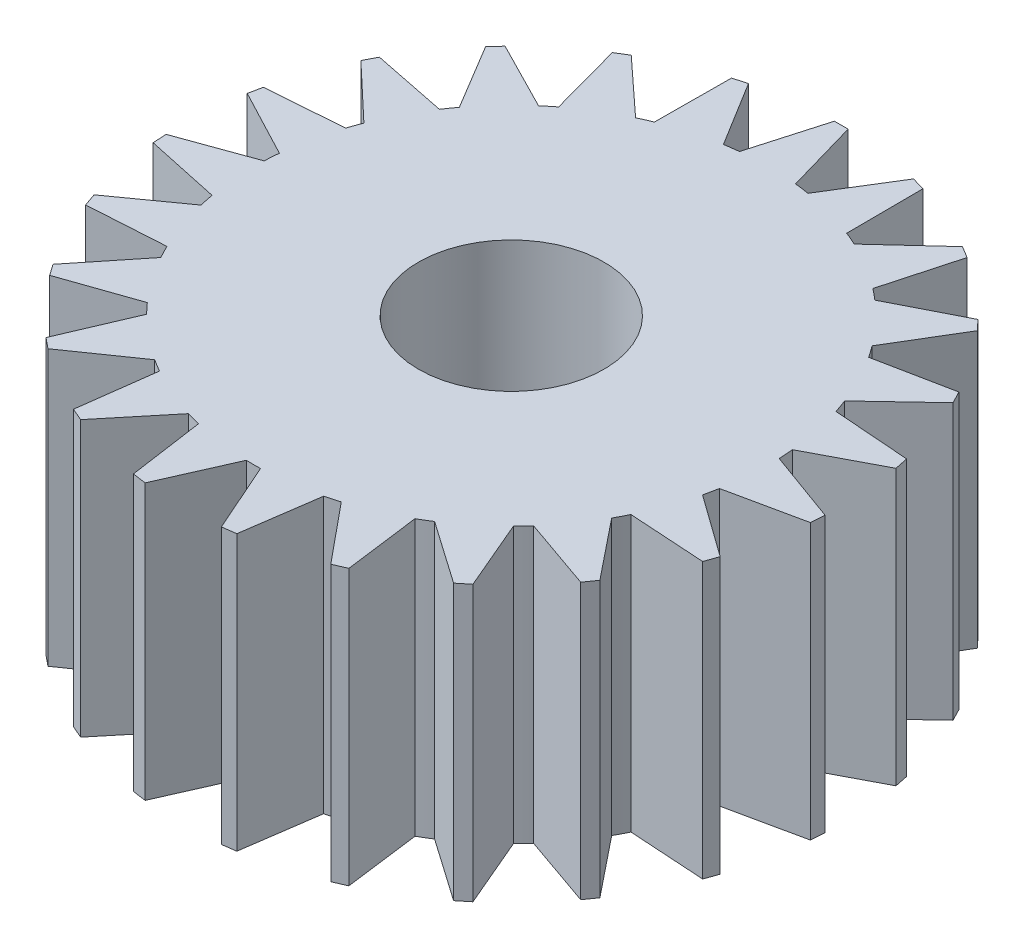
ISO-10303-21;
HEADER;
FILE_DESCRIPTION(('STEP AP214'),'2;1');
FILE_NAME('part.step','',(''),(''),'','','');
FILE_SCHEMA(('AUTOMOTIVE_DESIGN { 1 0 10303 214 1 1 1 1 }'));
ENDSEC;
DATA;
#1=APPLICATION_CONTEXT('core data for automotive mechanical design processes');
#2=APPLICATION_PROTOCOL_DEFINITION('international standard','automotive_design',2000,#1);
#3=PRODUCT_CONTEXT('',#1,'mechanical');
#4=PRODUCT('Part','Part','',(#3));
#5=PRODUCT_RELATED_PRODUCT_CATEGORY('part','',(#4));
#6=PRODUCT_DEFINITION_FORMATION('','',#4);
#7=PRODUCT_DEFINITION_CONTEXT('part definition',#1,'design');
#8=PRODUCT_DEFINITION('design','',#6,#7);
#9=PRODUCT_DEFINITION_SHAPE('','',#8);
#10=(LENGTH_UNIT() NAMED_UNIT(*) SI_UNIT(.MILLI.,.METRE.));
#11=(NAMED_UNIT(*) PLANE_ANGLE_UNIT() SI_UNIT($,.RADIAN.));
#12=(NAMED_UNIT(*) SI_UNIT($,.STERADIAN.) SOLID_ANGLE_UNIT());
#13=UNCERTAINTY_MEASURE_WITH_UNIT(LENGTH_MEASURE(1.E-05),#10,'distance_accuracy_value','');
#14=(GEOMETRIC_REPRESENTATION_CONTEXT(3) GLOBAL_UNCERTAINTY_ASSIGNED_CONTEXT((#13)) GLOBAL_UNIT_ASSIGNED_CONTEXT((#10,
#11,#12)) REPRESENTATION_CONTEXT('',''));
#15=CARTESIAN_POINT('',(0.,0.,0.));
#16=DIRECTION('',(0.,0.,1.));
#17=DIRECTION('',(1.,0.,0.));
#18=AXIS2_PLACEMENT_3D('',#15,#16,#17);
#19=CARTESIAN_POINT('',(-6.51605506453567,8.,-1.57787880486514));
#20=DIRECTION('',(0.,-1.,0.));
#21=DIRECTION('',(0.,0.,-1.));
#22=AXIS2_PLACEMENT_3D('',#19,#20,#21);
#23=CYLINDRICAL_SURFACE('',#22,7.5);
#24=DIRECTION('',(0.,-1.,0.));
#25=VECTOR('',#24,1.);
#26=CARTESIAN_POINT('',(-5.28306187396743,10.8165208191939,-8.97583310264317));
#27=LINE('',#26,#25);
#28=CARTESIAN_POINT('',(-5.28306187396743,8.,-8.97583310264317));
#29=VERTEX_POINT('',#28);
#30=CARTESIAN_POINT('',(-5.28306187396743,0.,-8.97583310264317));
#31=VERTEX_POINT('',#30);
#32=EDGE_CURVE('E623',#29,#31,#27,.T.);
#33=ORIENTED_EDGE('',*,*,#32,.T.);
#34=CARTESIAN_POINT('',(-6.51605506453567,0.,-1.57787880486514));
#35=DIRECTION('',(0.,1.,0.));
#36=DIRECTION('',(0.,0.,1.));
#37=AXIS2_PLACEMENT_3D('',#34,#35,#36);
#38=CIRCLE('',#37,7.5);
#39=CARTESIAN_POINT('',(-5.70115770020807,0.,-9.03347685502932));
#40=VERTEX_POINT('',#39);
#41=EDGE_CURVE('E1237',#31,#40,#38,.T.);
#42=ORIENTED_EDGE('',*,*,#41,.T.);
#43=DIRECTION('',(0.,-1.,0.));
#44=VECTOR('',#43,1.);
#45=CARTESIAN_POINT('',(-5.70115770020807,10.6934532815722,-9.03347685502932));
#46=LINE('',#45,#44);
#47=CARTESIAN_POINT('',(-5.70115770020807,8.,-9.03347685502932));
#48=VERTEX_POINT('',#47);
#49=EDGE_CURVE('E1221',#48,#40,#46,.T.);
#50=ORIENTED_EDGE('',*,*,#49,.F.);
#51=CARTESIAN_POINT('',(-6.51605506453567,8.,-1.57787880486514));
#52=DIRECTION('',(0.,1.,0.));
#53=DIRECTION('',(0.,0.,1.));
#54=AXIS2_PLACEMENT_3D('',#51,#52,#53);
#55=CIRCLE('',#54,7.5);
#56=EDGE_CURVE('E46',#29,#48,#55,.T.);
#57=ORIENTED_EDGE('',*,*,#56,.F.);
#58=EDGE_LOOP('',(#33,#42,#50,#57));
#59=FACE_BOUND('',#58,.T.);
#60=ADVANCED_FACE('F35',(#59),#23,.T.);
#61=CARTESIAN_POINT('',(-3.33309808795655,0.,-8.36896007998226));
#62=VERTEX_POINT('',#61);
#63=CARTESIAN_POINT('',(-3.71407194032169,0.,-8.53480992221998));
#64=VERTEX_POINT('',#63);
#65=EDGE_CURVE('E1240',#62,#64,#38,.T.);
#66=ORIENTED_EDGE('',*,*,#65,.T.);
#67=DIRECTION('',(0.,-1.,0.));
#68=VECTOR('',#67,1.);
#69=CARTESIAN_POINT('',(-3.71407194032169,10.8165208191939,-8.53480992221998));
#70=LINE('',#69,#68);
#71=CARTESIAN_POINT('',(-3.71407194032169,8.,-8.53480992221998));
#72=VERTEX_POINT('',#71);
#73=EDGE_CURVE('E60',#72,#64,#70,.T.);
#74=ORIENTED_EDGE('',*,*,#73,.F.);
#75=CARTESIAN_POINT('',(-3.33309808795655,8.,-8.36896007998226));
#76=VERTEX_POINT('',#75);
#77=EDGE_CURVE('E1303',#76,#72,#55,.T.);
#78=ORIENTED_EDGE('',*,*,#77,.F.);
#79=DIRECTION('',(0.,-1.,0.));
#80=VECTOR('',#79,1.);
#81=CARTESIAN_POINT('',(-3.33309808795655,11.0816159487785,-8.36896007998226));
#82=LINE('',#81,#80);
#83=EDGE_CURVE('E625',#76,#62,#82,.T.);
#84=ORIENTED_EDGE('',*,*,#83,.T.);
#85=EDGE_LOOP('',(#66,#74,#78,#84));
#86=FACE_BOUND('',#85,.T.);
#87=ADVANCED_FACE('F1424',(#86),#23,.T.);
#88=CARTESIAN_POINT('',(-1.61913449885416,0.,-7.25856265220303));
#89=VERTEX_POINT('',#88);
#90=CARTESIAN_POINT('',(-1.94124501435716,0.,-7.52103562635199));
#91=VERTEX_POINT('',#90);
#92=EDGE_CURVE('E1241',#89,#91,#38,.T.);
#93=ORIENTED_EDGE('',*,*,#92,.T.);
#94=DIRECTION('',(0.,-1.,0.));
#95=VECTOR('',#94,1.);
#96=CARTESIAN_POINT('',(-1.94124501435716,11.0816159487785,-7.52103562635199));
#97=LINE('',#96,#95);
#98=CARTESIAN_POINT('',(-1.94124501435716,8.,-7.52103562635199));
#99=VERTEX_POINT('',#98);
#100=EDGE_CURVE('E654',#99,#91,#97,.T.);
#101=ORIENTED_EDGE('',*,*,#100,.F.);
#102=CARTESIAN_POINT('',(-1.61913449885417,8.,-7.25856265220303));
#103=VERTEX_POINT('',#102);
#104=EDGE_CURVE('E1299',#103,#99,#55,.T.);
#105=ORIENTED_EDGE('',*,*,#104,.F.);
#106=DIRECTION('',(0.,-1.,0.));
#107=VECTOR('',#106,1.);
#108=CARTESIAN_POINT('',(-1.61913449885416,11.157620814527,-7.25856265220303));
#109=LINE('',#108,#107);
#110=EDGE_CURVE('E660',#103,#89,#109,.T.);
#111=ORIENTED_EDGE('',*,*,#110,.T.);
#112=EDGE_LOOP('',(#93,#101,#105,#111));
#113=FACE_BOUND('',#112,.T.);
#114=ADVANCED_FACE('F1282',(#113),#23,.T.);
#115=CARTESIAN_POINT('',(-0.268252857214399,0.,-5.72697118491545));
#116=VERTEX_POINT('',#115);
#117=CARTESIAN_POINT('',(-0.507617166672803,0.,-6.06660624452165));
#118=VERTEX_POINT('',#117);
#119=EDGE_CURVE('E1278',#116,#118,#38,.T.);
#120=ORIENTED_EDGE('',*,*,#119,.T.);
#121=DIRECTION('',(0.,-1.,0.));
#122=VECTOR('',#121,1.);
#123=CARTESIAN_POINT('',(-0.507617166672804,11.157620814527,-6.06660624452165));
#124=LINE('',#123,#122);
#125=CARTESIAN_POINT('',(-0.507617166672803,8.,-6.06660624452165));
#126=VERTEX_POINT('',#125);
#127=EDGE_CURVE('E681',#126,#118,#124,.T.);
#128=ORIENTED_EDGE('',*,*,#127,.F.);
#129=CARTESIAN_POINT('',(-0.268252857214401,8.,-5.72697118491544));
#130=VERTEX_POINT('',#129);
#131=EDGE_CURVE('E1302',#130,#126,#55,.T.);
#132=ORIENTED_EDGE('',*,*,#131,.F.);
#133=DIRECTION('',(0.,-1.,0.));
#134=VECTOR('',#133,1.);
#135=CARTESIAN_POINT('',(-0.268252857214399,11.0299958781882,-5.72697118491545));
#136=LINE('',#135,#134);
#137=EDGE_CURVE('E687',#130,#116,#136,.T.);
#138=ORIENTED_EDGE('',*,*,#137,.T.);
#139=EDGE_LOOP('',(#120,#128,#132,#138));
#140=FACE_BOUND('',#139,.T.);
#141=ADVANCED_FACE('F1405',(#140),#23,.T.);
#142=CARTESIAN_POINT('',(0.61938578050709,0.,-3.88774545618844));
#143=VERTEX_POINT('',#142);
#144=CARTESIAN_POINT('',(0.480515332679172,0.,-4.27936037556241));
#145=VERTEX_POINT('',#144);
#146=EDGE_CURVE('E1276',#143,#145,#38,.T.);
#147=ORIENTED_EDGE('',*,*,#146,.T.);
#148=DIRECTION('',(0.,-1.,0.));
#149=VECTOR('',#148,1.);
#150=CARTESIAN_POINT('',(0.480515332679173,11.0299958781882,-4.27936037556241));
#151=LINE('',#150,#149);
#152=CARTESIAN_POINT('',(0.480515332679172,8.,-4.27936037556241));
#153=VERTEX_POINT('',#152);
#154=EDGE_CURVE('E708',#153,#145,#151,.T.);
#155=ORIENTED_EDGE('',*,*,#154,.F.);
#156=CARTESIAN_POINT('',(0.619385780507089,8.,-3.88774545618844));
#157=VERTEX_POINT('',#156);
#158=EDGE_CURVE('E1305',#157,#153,#55,.T.);
#159=ORIENTED_EDGE('',*,*,#158,.F.);
#160=DIRECTION('',(0.,-1.,0.));
#161=VECTOR('',#160,1.);
#162=CARTESIAN_POINT('',(0.61938578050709,10.8041125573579,-3.88774545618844));
#163=LINE('',#162,#161);
#164=EDGE_CURVE('E714',#157,#143,#163,.T.);
#165=ORIENTED_EDGE('',*,*,#164,.T.);
#166=EDGE_LOOP('',(#147,#155,#159,#165));
#167=FACE_BOUND('',#166,.T.);
#168=ADVANCED_FACE('F1502',(#167),#23,.T.);
#169=CARTESIAN_POINT('',(0.977967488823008,0.,-1.87725477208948));
#170=VERTEX_POINT('',#169);
#171=CARTESIAN_POINT('',(0.949887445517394,0.,-2.29181328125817));
#172=VERTEX_POINT('',#171);
#173=EDGE_CURVE('E1274',#170,#172,#38,.T.);
#174=ORIENTED_EDGE('',*,*,#173,.T.);
#175=DIRECTION('',(0.,-1.,0.));
#176=VECTOR('',#175,1.);
#177=CARTESIAN_POINT('',(0.949887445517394,10.8041125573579,-2.29181328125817));
#178=LINE('',#177,#176);
#179=CARTESIAN_POINT('',(0.949887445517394,8.,-2.29181328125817));
#180=VERTEX_POINT('',#179);
#181=EDGE_CURVE('E735',#180,#172,#178,.T.);
#182=ORIENTED_EDGE('',*,*,#181,.F.);
#183=CARTESIAN_POINT('',(0.977967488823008,8.,-1.87725477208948));
#184=VERTEX_POINT('',#183);
#185=EDGE_CURVE('E1382',#184,#180,#55,.T.);
#186=ORIENTED_EDGE('',*,*,#185,.F.);
#187=DIRECTION('',(0.,-1.,0.));
#188=VECTOR('',#187,1.);
#189=CARTESIAN_POINT('',(0.977967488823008,10.7430421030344,-1.87725477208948));
#190=LINE('',#189,#188);
#191=EDGE_CURVE('E741',#184,#170,#190,.T.);
#192=ORIENTED_EDGE('',*,*,#191,.T.);
#193=EDGE_LOOP('',(#174,#182,#186,#192));
#194=FACE_BOUND('',#193,.T.);
#195=ADVANCED_FACE('F1498',(#194),#23,.T.);
#196=CARTESIAN_POINT('',(0.780905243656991,0.,0.155433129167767));
#197=VERTEX_POINT('',#196);
#198=CARTESIAN_POINT('',(0.865697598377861,0.,-0.25133154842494));
#199=VERTEX_POINT('',#198);
#200=EDGE_CURVE('E1272',#197,#199,#38,.T.);
#201=ORIENTED_EDGE('',*,*,#200,.T.);
#202=DIRECTION('',(0.,-1.,0.));
#203=VECTOR('',#202,1.);
#204=CARTESIAN_POINT('',(0.86569759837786,10.7430421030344,-0.251331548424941));
#205=LINE('',#204,#203);
#206=CARTESIAN_POINT('',(0.865697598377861,8.,-0.25133154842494));
#207=VERTEX_POINT('',#206);
#208=EDGE_CURVE('E762',#207,#199,#205,.T.);
#209=ORIENTED_EDGE('',*,*,#208,.F.);
#210=CARTESIAN_POINT('',(0.780905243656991,8.,0.155433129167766));
#211=VERTEX_POINT('',#210);
#212=EDGE_CURVE('E1379',#211,#207,#55,.T.);
#213=ORIENTED_EDGE('',*,*,#212,.F.);
#214=DIRECTION('',(0.,-1.,0.));
#215=VECTOR('',#214,1.);
#216=CARTESIAN_POINT('',(0.780905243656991,10.8947379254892,0.155433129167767));
#217=LINE('',#216,#215);
#218=EDGE_CURVE('E768',#211,#197,#217,.T.);
#219=ORIENTED_EDGE('',*,*,#218,.T.);
#220=EDGE_LOOP('',(#201,#209,#213,#219));
#221=FACE_BOUND('',#220,.T.);
#222=ADVANCED_FACE('F1494',(#221),#23,.T.);
#223=CARTESIAN_POINT('',(0.0428102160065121,0.,2.0596046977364));
#224=VERTEX_POINT('',#223);
#225=CARTESIAN_POINT('',(0.234188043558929,0.,1.69079339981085));
#226=VERTEX_POINT('',#225);
#227=EDGE_CURVE('E1270',#224,#226,#38,.T.);
#228=ORIENTED_EDGE('',*,*,#227,.T.);
#229=DIRECTION('',(0.,-1.,0.));
#230=VECTOR('',#229,1.);
#231=CARTESIAN_POINT('',(0.234188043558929,10.8947379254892,1.69079339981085));
#232=LINE('',#231,#230);
#233=CARTESIAN_POINT('',(0.234188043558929,8.,1.69079339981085));
#234=VERTEX_POINT('',#233);
#235=EDGE_CURVE('E789',#234,#226,#232,.T.);
#236=ORIENTED_EDGE('',*,*,#235,.F.);
#237=CARTESIAN_POINT('',(0.0428102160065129,8.,2.05960469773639));
#238=VERTEX_POINT('',#237);
#239=EDGE_CURVE('E1376',#238,#234,#55,.T.);
#240=ORIENTED_EDGE('',*,*,#239,.F.);
#241=DIRECTION('',(0.,-1.,0.));
#242=VECTOR('',#241,1.);
#243=CARTESIAN_POINT('',(0.0428102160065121,11.1195365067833,2.0596046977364));
#244=LINE('',#243,#242);
#245=EDGE_CURVE('E795',#238,#224,#244,.T.);
#246=ORIENTED_EDGE('',*,*,#245,.T.);
#247=EDGE_LOOP('',(#228,#236,#240,#246));
#248=FACE_BOUND('',#247,.T.);
#249=ADVANCED_FACE('F1490',(#248),#23,.T.);
#250=CARTESIAN_POINT('',(-1.18159157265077,0.,3.69407522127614));
#251=VERTEX_POINT('',#250);
#252=CARTESIAN_POINT('',(-0.89781797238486,0.,3.39056279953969));
#253=VERTEX_POINT('',#252);
#254=EDGE_CURVE('E1268',#251,#253,#38,.T.);
#255=ORIENTED_EDGE('',*,*,#254,.T.);
#256=DIRECTION('',(0.,-1.,0.));
#257=VECTOR('',#256,1.);
#258=CARTESIAN_POINT('',(-0.89781797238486,11.1195365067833,3.39056279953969));
#259=LINE('',#258,#257);
#260=CARTESIAN_POINT('',(-0.89781797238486,8.,3.39056279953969));
#261=VERTEX_POINT('',#260);
#262=EDGE_CURVE('E816',#261,#253,#259,.T.);
#263=ORIENTED_EDGE('',*,*,#262,.F.);
#264=CARTESIAN_POINT('',(-1.18159157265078,8.,3.69407522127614));
#265=VERTEX_POINT('',#264);
#266=EDGE_CURVE('E1373',#265,#261,#55,.T.);
#267=ORIENTED_EDGE('',*,*,#266,.F.);
#268=DIRECTION('',(0.,-1.,0.));
#269=VECTOR('',#268,1.);
#270=CARTESIAN_POINT('',(-1.18159157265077,11.1447079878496,3.69407522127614));
#271=LINE('',#270,#269);
#272=EDGE_CURVE('E822',#265,#251,#271,.T.);
#273=ORIENTED_EDGE('',*,*,#272,.T.);
#274=EDGE_LOOP('',(#255,#263,#267,#273));
#275=FACE_BOUND('',#274,.T.);
#276=ADVANCED_FACE('F1486',(#275),#23,.T.);
#277=CARTESIAN_POINT('',(-2.80151690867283,0.,4.93765695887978));
#278=VERTEX_POINT('',#277);
#279=CARTESIAN_POINT('',(-2.44638791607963,0.,4.72194732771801));
#280=VERTEX_POINT('',#279);
#281=EDGE_CURVE('E1266',#278,#280,#38,.T.);
#282=ORIENTED_EDGE('',*,*,#281,.T.);
#283=DIRECTION('',(0.,-1.,0.));
#284=VECTOR('',#283,1.);
#285=CARTESIAN_POINT('',(-2.44638791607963,11.1447079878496,4.72194732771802));
#286=LINE('',#285,#284);
#287=CARTESIAN_POINT('',(-2.44638791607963,8.,4.72194732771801));
#288=VERTEX_POINT('',#287);
#289=EDGE_CURVE('E843',#288,#280,#286,.T.);
#290=ORIENTED_EDGE('',*,*,#289,.F.);
#291=CARTESIAN_POINT('',(-2.80151690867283,8.,4.93765695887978));
#292=VERTEX_POINT('',#291);
#293=EDGE_CURVE('E1370',#292,#288,#55,.T.);
#294=ORIENTED_EDGE('',*,*,#293,.F.);
#295=DIRECTION('',(0.,-1.,0.));
#296=VECTOR('',#295,1.);
#297=CARTESIAN_POINT('',(-2.80151690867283,10.9676001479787,4.93765695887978));
#298=LINE('',#297,#296);
#299=EDGE_CURVE('E849',#292,#278,#298,.T.);
#300=ORIENTED_EDGE('',*,*,#299,.T.);
#301=EDGE_LOOP('',(#282,#290,#294,#300));
#302=FACE_BOUND('',#301,.T.);
#303=ADVANCED_FACE('F1482',(#302),#23,.T.);
#304=CARTESIAN_POINT('',(-4.69685650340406,0.,5.69814460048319));
#305=VERTEX_POINT('',#304);
#306=CARTESIAN_POINT('',(-4.29670314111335,0.,5.58623154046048));
#307=VERTEX_POINT('',#306);
#308=EDGE_CURVE('E1264',#305,#307,#38,.T.);
#309=ORIENTED_EDGE('',*,*,#308,.T.);
#310=DIRECTION('',(0.,-1.,0.));
#311=VECTOR('',#310,1.);
#312=CARTESIAN_POINT('',(-4.29670314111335,10.9676001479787,5.58623154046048));
#313=LINE('',#312,#311);
#314=CARTESIAN_POINT('',(-4.29670314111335,8.,5.58623154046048));
#315=VERTEX_POINT('',#314);
#316=EDGE_CURVE('E870',#315,#307,#313,.T.);
#317=ORIENTED_EDGE('',*,*,#316,.F.);
#318=CARTESIAN_POINT('',(-4.69685650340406,8.,5.69814460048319));
#319=VERTEX_POINT('',#318);
#320=EDGE_CURVE('E1367',#319,#315,#55,.T.);
#321=ORIENTED_EDGE('',*,*,#320,.F.);
#322=DIRECTION('',(0.,-1.,0.));
#323=VECTOR('',#322,1.);
#324=CARTESIAN_POINT('',(-4.69685650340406,10.7794429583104,5.69814460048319));
#325=LINE('',#324,#323);
#326=EDGE_CURVE('E876',#319,#305,#325,.T.);
#327=ORIENTED_EDGE('',*,*,#326,.T.);
#328=EDGE_LOOP('',(#309,#317,#321,#327));
#329=FACE_BOUND('',#328,.T.);
#330=ADVANCED_FACE('F1478',(#329),#23,.T.);
#331=CARTESIAN_POINT('',(-6.72708049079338,0.,5.91915182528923));
#332=VERTEX_POINT('',#331);
#333=CARTESIAN_POINT('',(-6.31157211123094,0.,5.91933312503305));
#334=VERTEX_POINT('',#333);
#335=EDGE_CURVE('E1262',#332,#334,#38,.T.);
#336=ORIENTED_EDGE('',*,*,#335,.T.);
#337=DIRECTION('',(0.,-1.,0.));
#338=VECTOR('',#337,1.);
#339=CARTESIAN_POINT('',(-6.31157211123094,10.7794429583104,5.91933312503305));
#340=LINE('',#339,#338);
#341=CARTESIAN_POINT('',(-6.31157211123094,8.,5.91933312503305));
#342=VERTEX_POINT('',#341);
#343=EDGE_CURVE('E897',#342,#334,#340,.T.);
#344=ORIENTED_EDGE('',*,*,#343,.F.);
#345=CARTESIAN_POINT('',(-6.72708049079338,8.,5.91915182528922));
#346=VERTEX_POINT('',#345);
#347=EDGE_CURVE('E1364',#346,#342,#55,.T.);
#348=ORIENTED_EDGE('',*,*,#347,.F.);
#349=DIRECTION('',(0.,-1.,0.));
#350=VECTOR('',#349,1.);
#351=CARTESIAN_POINT('',(-6.72708049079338,10.7798373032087,5.91915182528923));
#352=LINE('',#351,#350);
#353=EDGE_CURVE('E903',#346,#332,#352,.T.);
#354=ORIENTED_EDGE('',*,*,#353,.T.);
#355=EDGE_LOOP('',(#336,#344,#348,#354));
#356=FACE_BOUND('',#355,.T.);
#357=ADVANCED_FACE('F1474',(#356),#23,.T.);
#358=CARTESIAN_POINT('',(-8.74165800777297,0.,5.58429206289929));
#359=VERTEX_POINT('',#358);
#360=CARTESIAN_POINT('',(-8.34160246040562,0.,5.69655427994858));
#361=VERTEX_POINT('',#360);
#362=EDGE_CURVE('E1260',#359,#361,#38,.T.);
#363=ORIENTED_EDGE('',*,*,#362,.T.);
#364=DIRECTION('',(0.,-1.,0.));
#365=VECTOR('',#364,1.);
#366=CARTESIAN_POINT('',(-8.34160246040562,10.7798373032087,5.69655427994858));
#367=LINE('',#366,#365);
#368=CARTESIAN_POINT('',(-8.34160246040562,8.,5.69655427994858));
#369=VERTEX_POINT('',#368);
#370=EDGE_CURVE('E924',#369,#361,#367,.T.);
#371=ORIENTED_EDGE('',*,*,#370,.F.);
#372=CARTESIAN_POINT('',(-8.74165800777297,8.,5.58429206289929));
#373=VERTEX_POINT('',#372);
#374=EDGE_CURVE('E1361',#373,#369,#55,.T.);
#375=ORIENTED_EDGE('',*,*,#374,.F.);
#376=DIRECTION('',(0.,-1.,0.));
#377=VECTOR('',#376,1.);
#378=CARTESIAN_POINT('',(-8.74165800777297,10.9684737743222,5.58429206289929));
#379=LINE('',#378,#377);
#380=EDGE_CURVE('E930',#373,#359,#379,.T.);
#381=ORIENTED_EDGE('',*,*,#380,.T.);
#382=EDGE_LOOP('',(#363,#371,#375,#381));
#383=FACE_BOUND('',#382,.T.);
#384=ADVANCED_FACE('F1470',(#383),#23,.T.);
#385=CARTESIAN_POINT('',(-10.5912182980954,0.,4.71839347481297));
#386=VERTEX_POINT('',#385);
#387=CARTESIAN_POINT('',(-10.236277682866,0.,4.93441293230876));
#388=VERTEX_POINT('',#387);
#389=EDGE_CURVE('E1258',#386,#388,#38,.T.);
#390=ORIENTED_EDGE('',*,*,#389,.T.);
#391=DIRECTION('',(0.,-1.,0.));
#392=VECTOR('',#391,1.);
#393=CARTESIAN_POINT('',(-10.236277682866,10.9684737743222,4.93441293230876));
#394=LINE('',#393,#392);
#395=CARTESIAN_POINT('',(-10.236277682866,8.,4.93441293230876));
#396=VERTEX_POINT('',#395);
#397=EDGE_CURVE('E951',#396,#388,#394,.T.);
#398=ORIENTED_EDGE('',*,*,#397,.F.);
#399=CARTESIAN_POINT('',(-10.5912182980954,8.,4.71839347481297));
#400=VERTEX_POINT('',#399);
#401=EDGE_CURVE('E1358',#400,#396,#55,.T.);
#402=ORIENTED_EDGE('',*,*,#401,.F.);
#403=DIRECTION('',(0.,-1.,0.));
#404=VECTOR('',#403,1.);
#405=CARTESIAN_POINT('',(-10.5912182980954,11.1449539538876,4.71839347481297));
#406=LINE('',#405,#404);
#407=EDGE_CURVE('E957',#400,#386,#406,.T.);
#408=ORIENTED_EDGE('',*,*,#407,.T.);
#409=EDGE_LOOP('',(#390,#398,#402,#408));
#410=FACE_BOUND('',#409,.T.);
#411=ADVANCED_FACE('F1466',(#410),#23,.T.);
#412=CARTESIAN_POINT('',(-12.1386258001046,0.,3.38565807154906));
#413=VERTEX_POINT('',#412);
#414=CARTESIAN_POINT('',(-11.8551171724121,0.,3.68941801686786));
#415=VERTEX_POINT('',#414);
#416=EDGE_CURVE('E1256',#413,#415,#38,.T.);
#417=ORIENTED_EDGE('',*,*,#416,.T.);
#418=DIRECTION('',(0.,-1.,0.));
#419=VECTOR('',#418,1.);
#420=CARTESIAN_POINT('',(-11.855117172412,11.1449539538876,3.68941801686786));
#421=LINE('',#420,#419);
#422=CARTESIAN_POINT('',(-11.8551171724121,8.,3.68941801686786));
#423=VERTEX_POINT('',#422);
#424=EDGE_CURVE('E978',#423,#415,#421,.T.);
#425=ORIENTED_EDGE('',*,*,#424,.F.);
#426=CARTESIAN_POINT('',(-12.1386258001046,8.,3.38565807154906));
#427=VERTEX_POINT('',#426);
#428=EDGE_CURVE('E1355',#427,#423,#55,.T.);
#429=ORIENTED_EDGE('',*,*,#428,.F.);
#430=DIRECTION('',(0.,-1.,0.));
#431=VECTOR('',#430,1.);
#432=CARTESIAN_POINT('',(-12.1386258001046,11.1191290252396,3.38565807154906));
#433=LINE('',#432,#431);
#434=EDGE_CURVE('E984',#427,#413,#433,.T.);
#435=ORIENTED_EDGE('',*,*,#434,.T.);
#436=EDGE_LOOP('',(#417,#425,#429,#435));
#437=FACE_BOUND('',#436,.T.);
#438=ADVANCED_FACE('F1462',(#437),#23,.T.);
#439=CARTESIAN_POINT('',(-13.2691480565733,0.,1.68490145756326));
#440=VERTEX_POINT('',#439);
#441=CARTESIAN_POINT('',(-13.0780921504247,0.,2.05387962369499));
#442=VERTEX_POINT('',#441);
#443=EDGE_CURVE('E1254',#440,#442,#38,.T.);
#444=ORIENTED_EDGE('',*,*,#443,.T.);
#445=DIRECTION('',(0.,-1.,0.));
#446=VECTOR('',#445,1.);
#447=CARTESIAN_POINT('',(-13.0780921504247,11.1191290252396,2.05387962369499));
#448=LINE('',#447,#446);
#449=CARTESIAN_POINT('',(-13.0780921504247,8.,2.05387962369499));
#450=VERTEX_POINT('',#449);
#451=EDGE_CURVE('E1005',#450,#442,#448,.T.);
#452=ORIENTED_EDGE('',*,*,#451,.F.);
#453=CARTESIAN_POINT('',(-13.2691480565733,8.,1.68490145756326));
#454=VERTEX_POINT('',#453);
#455=EDGE_CURVE('E1352',#454,#450,#55,.T.);
#456=ORIENTED_EDGE('',*,*,#455,.F.);
#457=DIRECTION('',(0.,-1.,0.));
#458=VECTOR('',#457,1.);
#459=CARTESIAN_POINT('',(-13.2691480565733,10.8937201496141,1.68490145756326));
#460=LINE('',#459,#458);
#461=EDGE_CURVE('E1011',#454,#440,#460,.T.);
#462=ORIENTED_EDGE('',*,*,#461,.T.);
#463=EDGE_LOOP('',(#444,#452,#456,#462));
#464=FACE_BOUND('',#463,.T.);
#465=ADVANCED_FACE('F1458',(#464),#23,.T.);
#466=CARTESIAN_POINT('',(-13.8989625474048,0.,-0.257773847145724));
#467=VERTEX_POINT('',#466);
#468=CARTESIAN_POINT('',(-13.8145251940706,0.,0.149064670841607));
#469=VERTEX_POINT('',#468);
#470=EDGE_CURVE('E1252',#467,#469,#38,.T.);
#471=ORIENTED_EDGE('',*,*,#470,.T.);
#472=DIRECTION('',(0.,-1.,0.));
#473=VECTOR('',#472,1.);
#474=CARTESIAN_POINT('',(-13.8145251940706,10.8937201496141,0.149064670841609));
#475=LINE('',#474,#473);
#476=CARTESIAN_POINT('',(-13.8145251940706,8.,0.149064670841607));
#477=VERTEX_POINT('',#476);
#478=EDGE_CURVE('E1032',#477,#469,#475,.T.);
#479=ORIENTED_EDGE('',*,*,#478,.F.);
#480=CARTESIAN_POINT('',(-13.8989625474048,8.,-0.257773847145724));
#481=VERTEX_POINT('',#480);
#482=EDGE_CURVE('E1349',#481,#477,#55,.T.);
#483=ORIENTED_EDGE('',*,*,#482,.F.);
#484=DIRECTION('',(0.,-1.,0.));
#485=VECTOR('',#484,1.);
#486=CARTESIAN_POINT('',(-13.8989625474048,10.7424913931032,-0.257773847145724));
#487=LINE('',#486,#485);
#488=EDGE_CURVE('E1038',#481,#467,#487,.T.);
#489=ORIENTED_EDGE('',*,*,#488,.T.);
#490=EDGE_LOOP('',(#471,#479,#483,#489));
#491=FACE_BOUND('',#490,.T.);
#492=ADVANCED_FACE('F1454',(#491),#23,.T.);
#493=CARTESIAN_POINT('',(-13.981371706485,0.,-2.29832827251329));
#494=VERTEX_POINT('',#493);
#495=CARTESIAN_POINT('',(-14.009813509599,0.,-1.88379442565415));
#496=VERTEX_POINT('',#495);
#497=EDGE_CURVE('E1250',#494,#496,#38,.T.);
#498=ORIENTED_EDGE('',*,*,#497,.T.);
#499=DIRECTION('',(0.,-1.,0.));
#500=VECTOR('',#499,1.);
#501=CARTESIAN_POINT('',(-14.009813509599,10.7424913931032,-1.88379442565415));
#502=LINE('',#501,#500);
#503=CARTESIAN_POINT('',(-14.009813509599,8.,-1.88379442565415));
#504=VERTEX_POINT('',#503);
#505=EDGE_CURVE('E1059',#504,#496,#502,.T.);
#506=ORIENTED_EDGE('',*,*,#505,.F.);
#507=CARTESIAN_POINT('',(-13.981371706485,8.,-2.29832827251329));
#508=VERTEX_POINT('',#507);
#509=EDGE_CURVE('E1346',#508,#504,#55,.T.);
#510=ORIENTED_EDGE('',*,*,#509,.F.);
#511=DIRECTION('',(0.,-1.,0.));
#512=VECTOR('',#511,1.);
#513=CARTESIAN_POINT('',(-13.981371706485,10.8043484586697,-2.29832827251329));
#514=LINE('',#513,#512);
#515=EDGE_CURVE('E1065',#508,#494,#514,.T.);
#516=ORIENTED_EDGE('',*,*,#515,.T.);
#517=EDGE_LOOP('',(#498,#506,#510,#516));
#518=FACE_BOUND('',#517,.T.);
#519=ADVANCED_FACE('F1450',(#518),#23,.T.);
#520=CARTESIAN_POINT('',(-13.5102653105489,0.,-4.28546500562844));
#521=VERTEX_POINT('',#520);
#522=CARTESIAN_POINT('',(-13.6494774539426,0.,-3.8939714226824));
#523=VERTEX_POINT('',#522);
#524=EDGE_CURVE('E1248',#521,#523,#38,.T.);
#525=ORIENTED_EDGE('',*,*,#524,.T.);
#526=DIRECTION('',(0.,-1.,0.));
#527=VECTOR('',#526,1.);
#528=CARTESIAN_POINT('',(-13.6494774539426,10.8043484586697,-3.8939714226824));
#529=LINE('',#528,#527);
#530=CARTESIAN_POINT('',(-13.6494774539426,8.,-3.8939714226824));
#531=VERTEX_POINT('',#530);
#532=EDGE_CURVE('E1086',#531,#523,#529,.T.);
#533=ORIENTED_EDGE('',*,*,#532,.F.);
#534=CARTESIAN_POINT('',(-13.5102653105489,8.,-4.28546500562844));
#535=VERTEX_POINT('',#534);
#536=EDGE_CURVE('E1343',#535,#531,#55,.T.);
#537=ORIENTED_EDGE('',*,*,#536,.F.);
#538=DIRECTION('',(0.,-1.,0.));
#539=VECTOR('',#538,1.);
#540=CARTESIAN_POINT('',(-13.5102653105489,11.0307193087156,-4.28546500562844));
#541=LINE('',#540,#539);
#542=EDGE_CURVE('E1092',#535,#521,#541,.T.);
#543=ORIENTED_EDGE('',*,*,#542,.T.);
#544=EDGE_LOOP('',(#525,#533,#537,#543));
#545=FACE_BOUND('',#544,.T.);
#546=ADVANCED_FACE('F1446',(#545),#23,.T.);
#547=CARTESIAN_POINT('',(-12.5205735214,0.,-6.07184788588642));
#548=VERTEX_POINT('',#547);
#549=CARTESIAN_POINT('',(-12.7602341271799,0.,-5.73242184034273));
#550=VERTEX_POINT('',#549);
#551=EDGE_CURVE('E1246',#548,#550,#38,.T.);
#552=ORIENTED_EDGE('',*,*,#551,.T.);
#553=DIRECTION('',(0.,-1.,0.));
#554=VECTOR('',#553,1.);
#555=CARTESIAN_POINT('',(-12.7602341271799,11.0307193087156,-5.73242184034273));
#556=LINE('',#555,#554);
#557=CARTESIAN_POINT('',(-12.7602341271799,8.,-5.73242184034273));
#558=VERTEX_POINT('',#557);
#559=EDGE_CURVE('E1113',#558,#550,#556,.T.);
#560=ORIENTED_EDGE('',*,*,#559,.F.);
#561=CARTESIAN_POINT('',(-12.5205735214,8.,-6.07184788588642));
#562=VERTEX_POINT('',#561);
#563=EDGE_CURVE('E1340',#562,#558,#55,.T.);
#564=ORIENTED_EDGE('',*,*,#563,.F.);
#565=DIRECTION('',(0.,-1.,0.));
#566=VECTOR('',#565,1.);
#567=CARTESIAN_POINT('',(-12.5205735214,11.1577036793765,-6.07184788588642));
#568=LINE('',#567,#566);
#569=EDGE_CURVE('E1119',#562,#548,#568,.T.);
#570=ORIENTED_EDGE('',*,*,#569,.T.);
#571=EDGE_LOOP('',(#552,#560,#564,#570));
#572=FACE_BOUND('',#571,.T.);
#573=ADVANCED_FACE('F1442',(#572),#23,.T.);
#574=CARTESIAN_POINT('',(-11.0856769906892,0.,-7.52502563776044));
#575=VERTEX_POINT('',#574);
#576=CARTESIAN_POINT('',(-11.4080164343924,0.,-7.26283385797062));
#577=VERTEX_POINT('',#576);
#578=EDGE_CURVE('E1244',#575,#577,#38,.T.);
#579=ORIENTED_EDGE('',*,*,#578,.T.);
#580=DIRECTION('',(0.,-1.,0.));
#581=VECTOR('',#580,1.);
#582=CARTESIAN_POINT('',(-11.4080164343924,11.1577036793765,-7.26283385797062));
#583=LINE('',#582,#581);
#584=CARTESIAN_POINT('',(-11.4080164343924,8.,-7.26283385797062));
#585=VERTEX_POINT('',#584);
#586=EDGE_CURVE('E1140',#585,#577,#583,.T.);
#587=ORIENTED_EDGE('',*,*,#586,.F.);
#588=CARTESIAN_POINT('',(-11.0856769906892,8.,-7.52502563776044));
#589=VERTEX_POINT('',#588);
#590=EDGE_CURVE('E1338',#589,#585,#55,.T.);
#591=ORIENTED_EDGE('',*,*,#590,.F.);
#592=DIRECTION('',(0.,-1.,0.));
#593=VECTOR('',#592,1.);
#594=CARTESIAN_POINT('',(-11.0856769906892,11.0810496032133,-7.52502563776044));
#595=LINE('',#594,#593);
#596=EDGE_CURVE('E1146',#589,#575,#595,.T.);
#597=ORIENTED_EDGE('',*,*,#596,.T.);
#598=EDGE_LOOP('',(#579,#587,#591,#597));
#599=FACE_BOUND('',#598,.T.);
#600=ADVANCED_FACE('F1438',(#599),#23,.T.);
#601=CARTESIAN_POINT('',(-9.31196605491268,0.,-8.53725246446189));
#602=VERTEX_POINT('',#601);
#603=CARTESIAN_POINT('',(-9.69308449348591,0.,-8.37173514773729));
#604=VERTEX_POINT('',#603);
#605=EDGE_CURVE('E1242',#602,#604,#38,.T.);
#606=ORIENTED_EDGE('',*,*,#605,.T.);
#607=DIRECTION('',(0.,-1.,0.));
#608=VECTOR('',#607,1.);
#609=CARTESIAN_POINT('',(-9.69308449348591,11.0810496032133,-8.37173514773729));
#610=LINE('',#609,#608);
#611=CARTESIAN_POINT('',(-9.69308449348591,8.,-8.37173514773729));
#612=VERTEX_POINT('',#611);
#613=EDGE_CURVE('E1167',#612,#604,#610,.T.);
#614=ORIENTED_EDGE('',*,*,#613,.F.);
#615=CARTESIAN_POINT('',(-9.31196605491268,8.,-8.53725246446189));
#616=VERTEX_POINT('',#615);
#617=EDGE_CURVE('E44',#616,#612,#55,.T.);
#618=ORIENTED_EDGE('',*,*,#617,.F.);
#619=DIRECTION('',(0.,-1.,0.));
#620=VECTOR('',#619,1.);
#621=CARTESIAN_POINT('',(-9.31196605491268,10.8164466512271,-8.53725246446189));
#622=LINE('',#621,#620);
#623=EDGE_CURVE('E1173',#616,#602,#622,.T.);
#624=ORIENTED_EDGE('',*,*,#623,.T.);
#625=EDGE_LOOP('',(#606,#614,#618,#624));
#626=FACE_BOUND('',#625,.T.);
#627=ADVANCED_FACE('F1337',(#626),#23,.T.);
#628=CARTESIAN_POINT('',(-6.51605506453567,8.,-1.57787880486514));
#629=DIRECTION('',(0.,-1.,0.));
#630=DIRECTION('',(0.,0.,-1.));
#631=AXIS2_PLACEMENT_3D('',#628,#629,#630);
#632=CYLINDRICAL_SURFACE('',#631,2.7);
#633=CARTESIAN_POINT('',(-6.51605506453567,8.,-1.57787880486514));
#634=DIRECTION('',(0.,1.,0.));
#635=DIRECTION('',(0.,0.,1.));
#636=AXIS2_PLACEMENT_3D('',#633,#634,#635);
#637=CIRCLE('',#636,2.7);
#638=CARTESIAN_POINT('',(-6.51605506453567,8.,1.12212119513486));
#639=VERTEX_POINT('',#638);
#640=EDGE_CURVE('E1234',#639,#639,#637,.T.);
#641=ORIENTED_EDGE('',*,*,#640,.T.);
#642=EDGE_LOOP('',(#641));
#643=FACE_BOUND('',#642,.T.);
#644=CARTESIAN_POINT('',(-6.51605506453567,0.,-1.57787880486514));
#645=DIRECTION('',(0.,1.,0.));
#646=DIRECTION('',(0.,0.,1.));
#647=AXIS2_PLACEMENT_3D('',#644,#645,#646);
#648=CIRCLE('',#647,2.7);
#649=CARTESIAN_POINT('',(-6.51605506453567,0.,1.12212119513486));
#650=VERTEX_POINT('',#649);
#651=EDGE_CURVE('E1227',#650,#650,#648,.T.);
#652=ORIENTED_EDGE('',*,*,#651,.F.);
#653=EDGE_LOOP('',(#652));
#654=FACE_BOUND('',#653,.T.);
#655=ADVANCED_FACE('F37',(#643,#654),#632,.F.);
#656=CARTESIAN_POINT('',(-7.33095242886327,0.,-9.03347685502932));
#657=VERTEX_POINT('',#656);
#658=CARTESIAN_POINT('',(-7.74259185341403,0.,-8.97690627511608));
#659=VERTEX_POINT('',#658);
#660=EDGE_CURVE('E39',#657,#659,#38,.T.);
#661=ORIENTED_EDGE('',*,*,#660,.T.);
#662=DIRECTION('',(0.,-1.,0.));
#663=VECTOR('',#662,1.);
#664=CARTESIAN_POINT('',(-7.74259185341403,10.8164466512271,-8.97690627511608));
#665=LINE('',#664,#663);
#666=CARTESIAN_POINT('',(-7.74259185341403,8.,-8.97690627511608));
#667=VERTEX_POINT('',#666);
#668=EDGE_CURVE('E1194',#667,#659,#665,.T.);
#669=ORIENTED_EDGE('',*,*,#668,.F.);
#670=CARTESIAN_POINT('',(-7.33095242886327,8.,-9.03347685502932));
#671=VERTEX_POINT('',#670);
#672=EDGE_CURVE('E11',#671,#667,#55,.T.);
#673=ORIENTED_EDGE('',*,*,#672,.F.);
#674=DIRECTION('',(0.,-1.,0.));
#675=VECTOR('',#674,1.);
#676=CARTESIAN_POINT('',(-7.33095242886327,10.6934532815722,-9.03347685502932));
#677=LINE('',#676,#675);
#678=EDGE_CURVE('E1200',#671,#657,#677,.T.);
#679=ORIENTED_EDGE('',*,*,#678,.T.);
#680=EDGE_LOOP('',(#661,#669,#673,#679));
#681=FACE_BOUND('',#680,.T.);
#682=ADVANCED_FACE('F1321',(#681),#23,.T.);
#683=CARTESIAN_POINT('',(0.,8.,0.));
#684=DIRECTION('',(0.,1.,0.));
#685=DIRECTION('',(0.,0.,1.));
#686=AXIS2_PLACEMENT_3D('',#683,#684,#685);
#687=PLANE('',#686);
#688=ORIENTED_EDGE('',*,*,#640,.F.);
#689=EDGE_LOOP('',(#688));
#690=FACE_BOUND('',#689,.T.);
#691=ORIENTED_EDGE('',*,*,#672,.T.);
#692=DIRECTION('',(0.52472897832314,0.,0.851269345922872));
#693=VECTOR('',#692,1.);
#694=CARTESIAN_POINT('',(-2.36150283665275,8.,-0.247149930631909));
#695=LINE('',#694,#693);
#696=CARTESIAN_POINT('',(-8.91316782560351,8.,-10.8759350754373));
#697=VERTEX_POINT('',#696);
#698=EDGE_CURVE('E1195',#697,#667,#695,.T.);
#699=ORIENTED_EDGE('',*,*,#698,.F.);
#700=DIRECTION('',(0.962927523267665,0.,-0.269760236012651));
#701=VECTOR('',#700,1.);
#702=CARTESIAN_POINT('',(-2.83126456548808,8.,-12.5797555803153));
#703=LINE('',#702,#701);
#704=CARTESIAN_POINT('',(-9.29833883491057,8.,-10.7680309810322));
#705=VERTEX_POINT('',#704);
#706=EDGE_CURVE('E1191',#705,#697,#703,.T.);
#707=ORIENTED_EDGE('',*,*,#706,.F.);
#708=DIRECTION('',(-0.00610861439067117,0.,0.999981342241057));
#709=VECTOR('',#708,1.);
#710=CARTESIAN_POINT('',(-9.35266684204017,8.,-1.87452583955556));
#711=LINE('',#710,#709);
#712=EDGE_CURVE('E1190',#705,#616,#711,.T.);
#713=ORIENTED_EDGE('',*,*,#712,.T.);
#714=ORIENTED_EDGE('',*,*,#617,.T.);
#715=DIRECTION('',(0.734914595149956,0.,0.678159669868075));
#716=VECTOR('',#715,1.);
#717=CARTESIAN_POINT('',(-2.15654464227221,8.,-1.41721633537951));
#718=LINE('',#717,#716);
#719=CARTESIAN_POINT('',(-11.3325467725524,8.,-9.88458739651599));
#720=VERTEX_POINT('',#719);
#721=EDGE_CURVE('E1168',#720,#612,#718,.T.);
#722=ORIENTED_EDGE('',*,*,#721,.F.);
#723=DIRECTION('',(0.854458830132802,0.,-0.519519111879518));
#724=VECTOR('',#723,1.);
#725=CARTESIAN_POINT('',(-5.93573775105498,8.,-13.1658987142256));
#726=LINE('',#725,#724);
#727=CARTESIAN_POINT('',(-11.6743303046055,8.,-9.67677975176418));
#728=VERTEX_POINT('',#727);
#729=EDGE_CURVE('E1164',#728,#720,#726,.T.);
#730=ORIENTED_EDGE('',*,*,#729,.F.);
#731=DIRECTION('',(0.26387304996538,0.,0.964557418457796));
#732=VECTOR('',#731,1.);
#733=CARTESIAN_POINT('',(-9.3275301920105,8.,-1.09832333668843));
#734=LINE('',#733,#732);
#735=EDGE_CURVE('E1163',#728,#589,#734,.T.);
#736=ORIENTED_EDGE('',*,*,#735,.T.);
#737=ORIENTED_EDGE('',*,*,#590,.T.);
#738=DIRECTION('',(0.890610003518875,0.,0.454767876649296));
#739=VECTOR('',#738,1.);
#740=CARTESIAN_POINT('',(-2.27482214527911,8.,-2.59919505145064));
#741=LINE('',#740,#739);
#742=CARTESIAN_POINT('',(-13.3948071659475,8.,-8.27733919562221));
#743=VERTEX_POINT('',#742);
#744=EDGE_CURVE('E1141',#743,#585,#741,.T.);
#745=ORIENTED_EDGE('',*,*,#744,.F.);
#746=DIRECTION('',(0.68263632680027,0.,-0.730758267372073));
#747=VECTOR('',#746,1.);
#748=CARTESIAN_POINT('',(-9.08323853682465,8.,-12.8928486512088));
#749=LINE('',#748,#747);
#750=CARTESIAN_POINT('',(-13.6678616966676,8.,-7.98503588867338));
#751=VERTEX_POINT('',#750);
#752=EDGE_CURVE('E1137',#751,#743,#749,.T.);
#753=ORIENTED_EDGE('',*,*,#752,.F.);
#754=DIRECTION('',(0.514289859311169,0.,0.857616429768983));
#755=VECTOR('',#754,1.);
#756=CARTESIAN_POINT('',(-9.09393684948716,8.,-0.357677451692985));
#757=LINE('',#756,#755);
#758=EDGE_CURVE('E1136',#751,#562,#757,.T.);
#759=ORIENTED_EDGE('',*,*,#758,.T.);
#760=ORIENTED_EDGE('',*,*,#563,.T.);
#761=DIRECTION('',(0.980271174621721,0.,0.19765734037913));
#762=VECTOR('',#761,1.);
#763=CARTESIAN_POINT('',(-2.70756566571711,8.,-3.70544832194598));
#764=LINE('',#763,#762);
#765=CARTESIAN_POINT('',(-14.9470428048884,8.,-6.17335981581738));
#766=VERTEX_POINT('',#765);
#767=EDGE_CURVE('E1114',#766,#558,#764,.T.);
#768=ORIENTED_EDGE('',*,*,#767,.F.);
#769=DIRECTION('',(0.460199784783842,0.,-0.887815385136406));
#770=VECTOR('',#769,1.);
#771=CARTESIAN_POINT('',(-12.0403956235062,8.,-11.7808506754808));
#772=LINE('',#771,#770);
#773=CARTESIAN_POINT('',(-15.1311227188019,8.,-5.81823366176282));
#774=VERTEX_POINT('',#773);
#775=EDGE_CURVE('E1110',#774,#766,#772,.T.);
#776=ORIENTED_EDGE('',*,*,#775,.F.);
#777=DIRECTION('',(0.726574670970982,0.,0.687087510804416));
#778=VECTOR('',#777,1.);
#779=CARTESIAN_POINT('',(-8.66920658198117,8.,0.292496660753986));
#780=LINE('',#779,#778);
#781=EDGE_CURVE('E1109',#774,#535,#780,.T.);
#782=ORIENTED_EDGE('',*,*,#781,.T.);
#783=ORIENTED_EDGE('',*,*,#536,.T.);
#784=DIRECTION('',(0.997250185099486,0.,-0.0741084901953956));
#785=VECTOR('',#784,1.);
#786=CARTESIAN_POINT('',(-3.42268945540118,8.,-4.65395304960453));
#787=LINE('',#786,#785);
#788=CARTESIAN_POINT('',(-15.8741632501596,8.,-3.72864871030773));
#789=VERTEX_POINT('',#788);
#790=EDGE_CURVE('E1087',#789,#531,#787,.T.);
#791=ORIENTED_EDGE('',*,*,#790,.F.);
#792=DIRECTION('',(0.203641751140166,0.,-0.979045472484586));
#793=VECTOR('',#792,1.);
#794=CARTESIAN_POINT('',(-14.5879507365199,8.,-9.91235382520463));
#795=LINE('',#794,#793);
#796=CARTESIAN_POINT('',(-15.9556199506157,8.,-3.3370305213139));
#797=VERTEX_POINT('',#796);
#798=EDGE_CURVE('E1083',#797,#789,#795,.T.);
#799=ORIENTED_EDGE('',*,*,#798,.F.);
#800=DIRECTION('',(0.884987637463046,0.,0.465614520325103));
#801=VECTOR('',#800,1.);
#802=CARTESIAN_POINT('',(-8.08483099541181,8.,0.803991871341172));
#803=LINE('',#802,#801);
#804=EDGE_CURVE('E1082',#797,#508,#803,.T.);
#805=ORIENTED_EDGE('',*,*,#804,.T.);
#806=ORIENTED_EDGE('',*,*,#509,.T.);
#807=DIRECTION('',(0.94028812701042,0.,-0.340379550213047));
#808=VECTOR('',#807,1.);
#809=CARTESIAN_POINT('',(-4.36717069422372,8.,-5.37438239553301));
#810=LINE('',#809,#808);
#811=CARTESIAN_POINT('',(-16.1074271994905,8.,-1.12446887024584));
#812=VERTEX_POINT('',#811);
#813=EDGE_CURVE('E1060',#812,#504,#810,.T.);
#814=ORIENTED_EDGE('',*,*,#813,.F.);
#815=DIRECTION('',(-0.0680152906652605,0.,-0.997684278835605));
#816=VECTOR('',#815,1.);
#817=CARTESIAN_POINT('',(-16.5370155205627,8.,-7.42589771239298));
#818=LINE('',#817,#816);
#819=CARTESIAN_POINT('',(-16.0802210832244,8.,-0.725395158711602));
#820=VERTEX_POINT('',#819);
#821=EDGE_CURVE('E1056',#820,#812,#818,.T.);
#822=ORIENTED_EDGE('',*,*,#821,.F.);
#823=DIRECTION('',(0.977783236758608,0.,0.209618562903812));
#824=VECTOR('',#823,1.);
#825=CARTESIAN_POINT('',(-7.38413859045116,8.,1.13888339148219));
#826=LINE('',#825,#824);
#827=EDGE_CURVE('E1055',#820,#481,#826,.T.);
#828=ORIENTED_EDGE('',*,*,#827,.T.);
#829=ORIENTED_EDGE('',*,*,#482,.T.);
#830=DIRECTION('',(0.813608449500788,0.,-0.581413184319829));
#831=VECTOR('',#830,1.);
#832=CARTESIAN_POINT('',(-5.470980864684,8.,-5.81332015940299));
#833=LINE('',#832,#831);
#834=CARTESIAN_POINT('',(-15.6295393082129,8.,1.44609291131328));
#835=VERTEX_POINT('',#834);
#836=EDGE_CURVE('E1033',#835,#477,#833,.T.);
#837=ORIENTED_EDGE('',*,*,#836,.F.);
#838=DIRECTION('',(-0.334629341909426,0.,-0.942349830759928));
#839=VECTOR('',#838,1.);
#840=CARTESIAN_POINT('',(-17.7430766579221,8.,-4.5058405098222));
#841=LINE('',#840,#839);
#842=CARTESIAN_POINT('',(-15.4956875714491,8.,1.82303284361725));
#843=VERTEX_POINT('',#842);
#844=EDGE_CURVE('E1029',#843,#835,#841,.T.);
#845=ORIENTED_EDGE('',*,*,#844,.F.);
#846=DIRECTION('',(0.998081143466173,0.,-0.0619195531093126));
#847=VECTOR('',#846,1.);
#848=CARTESIAN_POINT('',(-6.61908217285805,8.,1.27234070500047));
#849=LINE('',#848,#847);
#850=EDGE_CURVE('E1028',#843,#454,#849,.T.);
#851=ORIENTED_EDGE('',*,*,#850,.T.);
#852=ORIENTED_EDGE('',*,*,#455,.T.);
#853=DIRECTION('',(0.626603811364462,0.,-0.779337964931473));
#854=VECTOR('',#853,1.);
#855=CARTESIAN_POINT('',(-6.65227801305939,8.,-5.93822132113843));
#856=LINE('',#855,#854);
#857=CARTESIAN_POINT('',(-14.4759325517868,8.,3.79244245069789));
#858=VERTEX_POINT('',#857);
#859=EDGE_CURVE('E1006',#858,#450,#856,.T.);
#860=ORIENTED_EDGE('',*,*,#859,.F.);
#861=DIRECTION('',(-0.576432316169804,0.,-0.817144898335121));
#862=VECTOR('',#861,1.);
#863=CARTESIAN_POINT('',(-18.1167108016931,8.,-1.36868972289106));
#864=LINE('',#863,#862);
#865=CARTESIAN_POINT('',(-14.2453596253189,8.,4.11930041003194));
#866=VERTEX_POINT('',#865);
#867=EDGE_CURVE('E1002',#866,#858,#864,.T.);
#868=ORIENTED_EDGE('',*,*,#867,.F.);
#869=DIRECTION('',(0.944376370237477,0.,-0.328866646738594));
#870=VECTOR('',#869,1.);
#871=CARTESIAN_POINT('',(-5.84638681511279,8.,1.19446862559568));
#872=LINE('',#871,#870);
#873=EDGE_CURVE('E1001',#866,#427,#872,.T.);
#874=ORIENTED_EDGE('',*,*,#873,.T.);
#875=ORIENTED_EDGE('',*,*,#428,.T.);
#876=DIRECTION('',(0.393139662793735,0.,-0.919478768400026));
#877=VECTOR('',#876,1.);
#878=CARTESIAN_POINT('',(-7.82347491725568,8.,-5.73982508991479));
#879=LINE('',#878,#877);
#880=CARTESIAN_POINT('',(-12.7321410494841,8.,5.74060977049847));
#881=VERTEX_POINT('',#880);
#882=EDGE_CURVE('E979',#881,#423,#879,.T.);
#883=ORIENTED_EDGE('',*,*,#882,.F.);
#884=DIRECTION('',(-0.775495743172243,0.,-0.631352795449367));
#885=VECTOR('',#884,1.);
#886=CARTESIAN_POINT('',(-17.6302148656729,8.,1.75295074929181));
#887=LINE('',#886,#885);
#888=CARTESIAN_POINT('',(-12.4219427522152,8.,5.99315088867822));
#889=VERTEX_POINT('',#888);
#890=EDGE_CURVE('E975',#889,#881,#887,.T.);
#891=ORIENTED_EDGE('',*,*,#890,.F.);
#892=DIRECTION('',(0.820650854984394,0.,-0.571429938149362));
#893=VECTOR('',#892,1.);
#894=CARTESIAN_POINT('',(-5.12334397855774,8.,0.911040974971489));
#895=LINE('',#894,#893);
#896=EDGE_CURVE('E974',#889,#400,#895,.T.);
#897=ORIENTED_EDGE('',*,*,#896,.T.);
#898=ORIENTED_EDGE('',*,*,#401,.T.);
#899=DIRECTION('',(0.130526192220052,0.,-0.99144486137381));
#900=VECTOR('',#899,1.);
#901=CARTESIAN_POINT('',(-8.89773323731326,8.,-5.2328415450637));
#902=LINE('',#901,#900);
#903=CARTESIAN_POINT('',(-10.527458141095,8.,7.14614809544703));
#904=VERTEX_POINT('',#903);
#905=EDGE_CURVE('E952',#904,#396,#902,.T.);
#906=ORIENTED_EDGE('',*,*,#905,.F.);
#907=DIRECTION('',(-0.91706007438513,0.,-0.398749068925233));
#908=VECTOR('',#907,1.);
#909=CARTESIAN_POINT('',(-16.3196600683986,8.,4.62762701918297));
#910=LINE('',#909,#908);
#911=CARTESIAN_POINT('',(-10.160634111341,8.,7.30564772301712));
#912=VERTEX_POINT('',#911);
#913=EDGE_CURVE('E948',#912,#904,#910,.T.);
#914=ORIENTED_EDGE('',*,*,#913,.F.);
#915=DIRECTION('',(0.636078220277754,0.,-0.771624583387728));
#916=VECTOR('',#915,1.);
#917=CARTESIAN_POINT('',(-4.50356364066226,8.,0.443072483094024));
#918=LINE('',#917,#916);
#919=EDGE_CURVE('E947',#912,#373,#918,.T.);
#920=ORIENTED_EDGE('',*,*,#919,.T.);
#921=ORIENTED_EDGE('',*,*,#374,.T.);
#922=DIRECTION('',(-0.141765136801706,0.,-0.989900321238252));
#923=VECTOR('',#922,1.);
#924=CARTESIAN_POINT('',(-9.79540214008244,8.,-4.4548609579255));
#925=LINE('',#924,#923);
#926=CARTESIAN_POINT('',(-8.0253499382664,8.,7.90484385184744));
#927=VERTEX_POINT('',#926);
#928=EDGE_CURVE('E925',#927,#369,#925,.T.);
#929=ORIENTED_EDGE('',*,*,#928,.F.);
#930=DIRECTION('',(-0.990629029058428,0.,-0.136580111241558));
#931=VECTOR('',#930,1.);
#932=CARTESIAN_POINT('',(-14.2822174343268,8.,7.04219634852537));
#933=LINE('',#932,#931);
#934=CARTESIAN_POINT('',(-7.62909832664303,8.,7.95947589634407));
#935=VERTEX_POINT('',#934);
#936=EDGE_CURVE('E921',#935,#927,#933,.T.);
#937=ORIENTED_EDGE('',*,*,#936,.F.);
#938=DIRECTION('',(0.404343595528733,0.,-0.914607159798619));
#939=VECTOR('',#938,1.);
#940=CARTESIAN_POINT('',(-4.03299938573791,8.,-0.174739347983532));
#941=LINE('',#940,#939);
#942=EDGE_CURVE('E920',#935,#346,#941,.T.);
#943=ORIENTED_EDGE('',*,*,#942,.T.);
#944=ORIENTED_EDGE('',*,*,#347,.T.);
#945=DIRECTION('',(-0.403545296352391,0.,-0.914959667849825));
#946=VECTOR('',#945,1.);
#947=CARTESIAN_POINT('',(-10.4499240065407,8.,-3.46356666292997));
#948=LINE('',#947,#946);
#949=CARTESIAN_POINT('',(-5.41133513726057,8.,7.96044357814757));
#950=VERTEX_POINT('',#949);
#951=EDGE_CURVE('E898',#950,#342,#948,.T.);
#952=ORIENTED_EDGE('',*,*,#951,.F.);
#953=DIRECTION('',(-0.990747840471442,0.,0.13571557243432));
#954=VECTOR('',#953,1.);
#955=CARTESIAN_POINT('',(-11.6689530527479,8.,8.8176306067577));
#956=LINE('',#955,#954);
#957=CARTESIAN_POINT('',(-5.01503600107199,8.,7.90615734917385));
#958=VERTEX_POINT('',#957);
#959=EDGE_CURVE('E894',#958,#950,#956,.T.);
#960=ORIENTED_EDGE('',*,*,#959,.F.);
#961=DIRECTION('',(0.142628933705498,0.,-0.989776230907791));
#962=VECTOR('',#961,1.);
#963=CARTESIAN_POINT('',(-3.74654117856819,8.,-0.89658688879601));
#964=LINE('',#963,#962);
#965=EDGE_CURVE('E893',#958,#319,#964,.T.);
#966=ORIENTED_EDGE('',*,*,#965,.T.);
#967=ORIENTED_EDGE('',*,*,#320,.T.);
#968=DIRECTION('',(-0.635404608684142,0.,-0.772179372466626));
#969=VECTOR('',#968,1.);
#970=CARTESIAN_POINT('',(-10.8127693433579,8.,-2.33245812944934));
#971=LINE('',#970,#969);
#972=CARTESIAN_POINT('',(-2.87922974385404,8.,7.30882483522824));
#973=VERTEX_POINT('',#972);
#974=EDGE_CURVE('E871',#973,#315,#971,.T.);
#975=ORIENTED_EDGE('',*,*,#974,.F.);
#976=DIRECTION('',(-0.917407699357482,0.,0.397948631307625));
#977=VECTOR('',#976,1.);
#978=CARTESIAN_POINT('',(-8.67362728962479,8.,9.82229030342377));
#979=LINE('',#978,#977);
#980=CARTESIAN_POINT('',(-2.51226666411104,8.,7.1496453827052));
#981=VERTEX_POINT('',#980);
#982=EDGE_CURVE('E867',#981,#973,#979,.T.);
#983=ORIENTED_EDGE('',*,*,#982,.F.);
#984=DIRECTION('',(-0.129660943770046,0.,-0.991558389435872));
#985=VECTOR('',#984,1.);
#986=CARTESIAN_POINT('',(-3.66542844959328,8.,-1.66894878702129));
#987=LINE('',#986,#985);
#988=EDGE_CURVE('E866',#981,#292,#987,.T.);
#989=ORIENTED_EDGE('',*,*,#988,.T.);
#990=ORIENTED_EDGE('',*,*,#293,.T.);
#991=DIRECTION('',(-0.820151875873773,0.,-0.572145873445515));
#992=VECTOR('',#991,1.);
#993=CARTESIAN_POINT('',(-10.8570349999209,8.,-1.14540134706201));
#994=LINE('',#993,#992);
#995=CARTESIAN_POINT('',(-0.616776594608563,8.,5.99830186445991));
#996=VERTEX_POINT('',#995);
#997=EDGE_CURVE('E844',#996,#288,#994,.T.);
#998=ORIENTED_EDGE('',*,*,#997,.F.);
#999=DIRECTION('',(-0.776046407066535,0.,0.6306758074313));
#1000=VECTOR('',#999,1.);
#1001=CARTESIAN_POINT('',(-5.51832843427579,8.,9.98168499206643));
#1002=LINE('',#1001,#1000);
#1003=CARTESIAN_POINT('',(-0.306358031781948,8.,5.74603154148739));
#1004=VERTEX_POINT('',#1003);
#1005=EDGE_CURVE('E840',#1004,#996,#1002,.T.);
#1006=ORIENTED_EDGE('',*,*,#1005,.F.);
#1007=DIRECTION('',(-0.392337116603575,0.,-0.919821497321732));
#1008=VECTOR('',#1007,1.);
#1009=CARTESIAN_POINT('',(-3.79567529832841,8.,-2.43455830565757));
#1010=LINE('',#1009,#1008);
#1011=EDGE_CURVE('E839',#1004,#265,#1010,.T.);
#1012=ORIENTED_EDGE('',*,*,#1011,.T.);
#1013=ORIENTED_EDGE('',*,*,#266,.T.);
#1014=DIRECTION('',(-0.944089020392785,0.,-0.329690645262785));
#1015=VECTOR('',#1014,1.);
#1016=CARTESIAN_POINT('',(-10.5794389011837,8.,0.00958941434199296));
#1017=LINE('',#1016,#1015);
#1018=CARTESIAN_POINT('',(1.20827482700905,8.,4.12604333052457));
#1019=VERTEX_POINT('',#1018);
#1020=EDGE_CURVE('E817',#1019,#261,#1017,.T.);
#1021=ORIENTED_EDGE('',*,*,#1020,.F.);
#1022=DIRECTION('',(-0.577145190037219,0.,0.816641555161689));
#1023=VECTOR('',#1022,1.);
#1024=CARTESIAN_POINT('',(-2.43700597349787,8.,9.28399636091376));
#1025=LINE('',#1024,#1023);
#1026=CARTESIAN_POINT('',(1.43913290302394,8.,3.7993867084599));
#1027=VERTEX_POINT('',#1026);
#1028=EDGE_CURVE('E813',#1027,#1019,#1025,.T.);
#1029=ORIENTED_EDGE('',*,*,#1028,.F.);
#1030=DIRECTION('',(-0.625923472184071,0.,-0.779884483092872));
#1031=VECTOR('',#1030,1.);
#1032=CARTESIAN_POINT('',(-4.1276245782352,8.,-3.13664936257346));
#1033=LINE('',#1032,#1031);
#1034=EDGE_CURVE('E812',#1027,#238,#1033,.T.);
#1035=ORIENTED_EDGE('',*,*,#1034,.T.);
#1036=ORIENTED_EDGE('',*,*,#239,.T.);
#1037=DIRECTION('',(-0.998026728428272,0.,-0.0627905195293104));
#1038=VECTOR('',#1037,1.);
#1039=CARTESIAN_POINT('',(-10.0005633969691,8.,1.04687741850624));
#1040=LINE('',#1039,#1038);
#1041=CARTESIAN_POINT('',(2.46060616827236,8.,1.83086775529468));
#1042=VERTEX_POINT('',#1041);
#1043=EDGE_CURVE('E790',#1042,#234,#1040,.T.);
#1044=ORIENTED_EDGE('',*,*,#1043,.F.);
#1045=DIRECTION('',(-0.335451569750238,0.,0.942057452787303));
#1046=VECTOR('',#1045,1.);
#1047=CARTESIAN_POINT('',(0.341875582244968,8.,7.78095450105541));
#1048=LINE('',#1047,#1046);
#1049=CARTESIAN_POINT('',(2.59478679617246,8.,1.45404477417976));
#1050=VERTEX_POINT('',#1049);
#1051=EDGE_CURVE('E786',#1050,#1042,#1048,.T.);
#1052=ORIENTED_EDGE('',*,*,#1051,.F.);
#1053=DIRECTION('',(-0.813100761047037,0.,-0.582122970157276));
#1054=VECTOR('',#1053,1.);
#1055=CARTESIAN_POINT('',(-4.63666392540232,8.,-3.72316544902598));
#1056=LINE('',#1055,#1054);
#1057=EDGE_CURVE('E785',#1050,#211,#1056,.T.);
#1058=ORIENTED_EDGE('',*,*,#1057,.T.);
#1059=ORIENTED_EDGE('',*,*,#212,.T.);
#1060=DIRECTION('',(-0.977965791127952,0.,0.208765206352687));
#1061=VECTOR('',#1060,1.);
#1062=CARTESIAN_POINT('',(-9.16332918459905,8.,1.88955299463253));
#1063=LINE('',#1062,#1061);
#1064=CARTESIAN_POINT('',(3.04736338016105,8.,-0.7170491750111));
#1065=VERTEX_POINT('',#1064);
#1066=EDGE_CURVE('E763',#1065,#207,#1063,.T.);
#1067=ORIENTED_EDGE('',*,*,#1066,.F.);
#1068=DIRECTION('',(-0.0688859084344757,0.,0.99762454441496));
#1069=VECTOR('',#1068,1.);
#1070=CARTESIAN_POINT('',(2.61227618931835,8.,5.584002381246));
#1071=LINE('',#1070,#1069);
#1072=CARTESIAN_POINT('',(3.07491774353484,8.,-1.11609899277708));
#1073=VERTEX_POINT('',#1072);
#1074=EDGE_CURVE('E759',#1073,#1065,#1071,.T.);
#1075=ORIENTED_EDGE('',*,*,#1074,.F.);
#1076=DIRECTION('',(-0.939990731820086,0.,-0.341199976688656));
#1077=VECTOR('',#1076,1.);
#1078=CARTESIAN_POINT('',(-5.28505064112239,8.,-4.15061935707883));
#1079=LINE('',#1078,#1077);
#1080=EDGE_CURVE('E758',#1073,#184,#1079,.T.);
#1081=ORIENTED_EDGE('',*,*,#1080,.T.);
#1082=ORIENTED_EDGE('',*,*,#185,.T.);
#1083=DIRECTION('',(-0.885393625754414,0.,0.464842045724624));
#1084=VECTOR('',#1083,1.);
#1085=CARTESIAN_POINT('',(-8.12981295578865,8.,2.47513600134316));
#1086=LINE('',#1085,#1084);
#1087=CARTESIAN_POINT('',(2.92504137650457,8.,-3.32879227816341));
#1088=VERTEX_POINT('',#1087);
#1089=EDGE_CURVE('E736',#1088,#180,#1086,.T.);
#1090=ORIENTED_EDGE('',*,*,#1089,.F.);
#1091=DIRECTION('',(0.202787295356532,0.,0.979222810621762));
#1092=VECTOR('',#1091,1.);
#1093=CARTESIAN_POINT('',(4.20585710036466,8.,2.85603291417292));
#1094=LINE('',#1093,#1092);
#1095=CARTESIAN_POINT('',(2.84392645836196,8.,-3.72048140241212));
#1096=VERTEX_POINT('',#1095);
#1097=EDGE_CURVE('E732',#1096,#1088,#1094,.T.);
#1098=ORIENTED_EDGE('',*,*,#1097,.F.);
#1099=DIRECTION('',(-0.997185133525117,0.,-0.0749787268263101));
#1100=VECTOR('',#1099,1.);
#1101=CARTESIAN_POINT('',(-6.02471012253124,8.,-4.38731753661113));
#1102=LINE('',#1101,#1100);
#1103=EDGE_CURVE('E731',#1096,#157,#1102,.T.);
#1104=ORIENTED_EDGE('',*,*,#1103,.T.);
#1105=ORIENTED_EDGE('',*,*,#158,.T.);
#1106=DIRECTION('',(-0.727173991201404,0.,0.686453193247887));
#1107=VECTOR('',#1106,1.);
#1108=CARTESIAN_POINT('',(-6.97664472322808,8.,2.76020841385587));
#1109=LINE('',#1108,#1107);
#1110=CARTESIAN_POINT('',(2.10270971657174,8.,-5.81071398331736));
#1111=VERTEX_POINT('',#1110);
#1112=EDGE_CURVE('E709',#1111,#153,#1109,.T.);
#1113=ORIENTED_EDGE('',*,*,#1112,.F.);
#1114=DIRECTION('',(0.459424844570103,0.,0.888216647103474));
#1115=VECTOR('',#1114,1.);
#1116=CARTESIAN_POINT('',(5.00446233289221,8.,-0.200688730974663));
#1117=LINE('',#1116,#1115);
#1118=CARTESIAN_POINT('',(1.9189397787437,8.,-6.16600064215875));
#1119=VERTEX_POINT('',#1118);
#1120=EDGE_CURVE('E705',#1119,#1111,#1117,.T.);
#1121=ORIENTED_EDGE('',*,*,#1120,.F.);
#1122=DIRECTION('',(-0.980443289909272,0.,0.196801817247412));
#1123=VECTOR('',#1122,1.);
#1124=CARTESIAN_POINT('',(-6.8008003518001,8.,-4.41571001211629));
#1125=LINE('',#1124,#1123);
#1126=EDGE_CURVE('E704',#1119,#130,#1125,.T.);
#1127=ORIENTED_EDGE('',*,*,#1126,.T.);
#1128=ORIENTED_EDGE('',*,*,#131,.T.);
#1129=DIRECTION('',(-0.51503807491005,0.,0.857167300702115));
#1130=VECTOR('',#1129,1.);
#1131=CARTESIAN_POINT('',(-5.78932609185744,8.,2.72363355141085));
#1132=LINE('',#1131,#1130);
#1133=CARTESIAN_POINT('',(0.641340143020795,8.,-7.97879232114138));
#1134=VERTEX_POINT('',#1133);
#1135=EDGE_CURVE('E682',#1134,#126,#1132,.T.);
#1136=ORIENTED_EDGE('',*,*,#1135,.F.);
#1137=DIRECTION('',(0.681998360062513,0.,0.731353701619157));
#1138=VECTOR('',#1137,1.);
#1139=CARTESIAN_POINT('',(4.94887933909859,8.,-3.35952207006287));
#1140=LINE('',#1139,#1138);
#1141=CARTESIAN_POINT('',(0.368540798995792,8.,-8.27133380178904));
#1142=VERTEX_POINT('',#1141);
#1143=EDGE_CURVE('E678',#1142,#1134,#1140,.T.);
#1144=ORIENTED_EDGE('',*,*,#1143,.F.);
#1145=DIRECTION('',(-0.89100652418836,0.,0.453990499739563));
#1146=VECTOR('',#1145,1.);
#1147=CARTESIAN_POINT('',(-7.55577815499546,8.,-4.23369162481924));
#1148=LINE('',#1147,#1146);
#1149=EDGE_CURVE('E677',#1142,#103,#1148,.T.);
#1150=ORIENTED_EDGE('',*,*,#1149,.T.);
#1151=ORIENTED_EDGE('',*,*,#104,.T.);
#1152=DIRECTION('',(-0.264714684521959,0.,0.964326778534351));
#1153=VECTOR('',#1152,1.);
#1154=CARTESIAN_POINT('',(-4.65589074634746,8.,2.36812325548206));
#1155=LINE('',#1154,#1153);
#1156=CARTESIAN_POINT('',(-1.35071416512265,8.,-9.67227522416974));
#1157=VERTEX_POINT('',#1156);
#1158=EDGE_CURVE('E655',#1157,#99,#1155,.T.);
#1159=ORIENTED_EDGE('',*,*,#1158,.F.);
#1160=DIRECTION('',(0.85400513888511,0.,0.520264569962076));
#1161=VECTOR('',#1160,1.);
#1162=CARTESIAN_POINT('',(4.04322931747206,8.,-6.38625555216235));
#1163=LINE('',#1162,#1161);
#1164=CARTESIAN_POINT('',(-1.69231622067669,8.,-9.88038105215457));
#1165=VERTEX_POINT('',#1164);
#1166=EDGE_CURVE('E651',#1165,#1157,#1163,.T.);
#1167=ORIENTED_EDGE('',*,*,#1166,.F.);
#1168=DIRECTION('',(-0.735506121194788,0.,0.677518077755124));
#1169=VECTOR('',#1168,1.);
#1170=CARTESIAN_POINT('',(-8.23366573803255,8.,-3.85475811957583));
#1171=LINE('',#1170,#1169);
#1172=EDGE_CURVE('E650',#1165,#76,#1171,.T.);
#1173=ORIENTED_EDGE('',*,*,#1172,.T.);
#1174=ORIENTED_EDGE('',*,*,#77,.T.);
#1175=DIRECTION('',(0.00523596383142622,0.,0.999986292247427));
#1176=VECTOR('',#1175,1.);
#1177=CARTESIAN_POINT('',(-3.66037719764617,8.,1.72003682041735));
#1178=LINE('',#1177,#1176);
#1179=CARTESIAN_POINT('',(-3.7257524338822,8.,-10.7655994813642));
#1180=VERTEX_POINT('',#1179);
#1181=EDGE_CURVE('E631',#1180,#72,#1178,.T.);
#1182=ORIENTED_EDGE('',*,*,#1181,.F.);
#1183=DIRECTION('',(0.962691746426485,0.,0.270600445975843));
#1184=VECTOR('',#1183,1.);
#1185=CARTESIAN_POINT('',(2.35466164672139,8.,-9.0564721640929));
#1186=LINE('',#1185,#1184);
#1187=CARTESIAN_POINT('',(-4.1108291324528,8.,-10.8738396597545));
#1188=VERTEX_POINT('',#1187);
#1189=EDGE_CURVE('E610',#1188,#1180,#1186,.T.);
#1190=ORIENTED_EDGE('',*,*,#1189,.F.);
#1191=DIRECTION('',(-0.525471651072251,0.,0.850811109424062));
#1192=VECTOR('',#1191,1.);
#1193=CARTESIAN_POINT('',(-8.78420115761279,8.,-3.30700550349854));
#1194=LINE('',#1193,#1192);
#1195=EDGE_CURVE('E621',#1188,#29,#1194,.T.);
#1196=ORIENTED_EDGE('',*,*,#1195,.T.);
#1197=ORIENTED_EDGE('',*,*,#56,.T.);
#1198=DIRECTION('',(0.275637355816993,0.,0.961261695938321));
#1199=VECTOR('',#1198,1.);
#1200=CARTESIAN_POINT('',(-2.8745001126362,8.,0.824249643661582));
#1201=LINE('',#1200,#1199);
#1202=CARTESIAN_POINT('',(-6.31605506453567,8.,-11.1778788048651));
#1203=VERTEX_POINT('',#1202);
#1204=EDGE_CURVE('E1222',#1203,#48,#1201,.T.);
#1205=ORIENTED_EDGE('',*,*,#1204,.F.);
#1206=DIRECTION('',(1.,0.,0.));
#1207=VECTOR('',#1206,1.);
#1208=CARTESIAN_POINT('',(0.,8.,-11.1778788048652));
#1209=LINE('',#1208,#1207);
#1210=CARTESIAN_POINT('',(-6.71605506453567,8.,-11.1778788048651));
#1211=VERTEX_POINT('',#1210);
#1212=EDGE_CURVE('E1218',#1211,#1203,#1209,.T.);
#1213=ORIENTED_EDGE('',*,*,#1212,.F.);
#1214=DIRECTION('',(-0.275637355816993,0.,0.961261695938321));
#1215=VECTOR('',#1214,1.);
#1216=CARTESIAN_POINT('',(-9.16748304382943,8.,-2.62873346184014));
#1217=LINE('',#1216,#1215);
#1218=EDGE_CURVE('E1217',#1211,#671,#1217,.T.);
#1219=ORIENTED_EDGE('',*,*,#1218,.T.);
#1220=EDGE_LOOP('',(#691,#699,#707,#713,#714,#722,#730,#736,#737,#745,#753,#759,#760,#768,#776,
#782,#783,#791,#799,#805,#806,#814,#822,#828,#829,#837,#845,#851,#852,#860,#868,#874,#875,#883,
#891,#897,#898,#906,#914,#920,#921,#929,#937,#943,#944,#952,#960,#966,#967,#975,#983,#989,#990,
#998,#1006,#1012,#1013,#1021,#1029,#1035,#1036,#1044,#1052,#1058,#1059,#1067,#1075,#1081,#1082,
#1090,#1098,#1104,#1105,#1113,#1121,#1127,#1128,#1136,#1144,#1150,#1151,#1159,#1167,#1173,#1174,
#1182,#1190,#1196,#1197,#1205,#1213,#1219));
#1221=FACE_BOUND('',#1220,.T.);
#1222=ADVANCED_FACE('F629',(#690,#1221),#687,.T.);
#1223=CARTESIAN_POINT('',(0.,0.,0.));
#1224=DIRECTION('',(0.,1.,0.));
#1225=DIRECTION('',(0.,0.,1.));
#1226=AXIS2_PLACEMENT_3D('',#1223,#1224,#1225);
#1227=PLANE('',#1226);
#1228=ORIENTED_EDGE('',*,*,#651,.T.);
#1229=EDGE_LOOP('',(#1228));
#1230=FACE_BOUND('',#1229,.T.);
#1231=ORIENTED_EDGE('',*,*,#660,.F.);
#1232=DIRECTION('',(-0.275637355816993,0.,0.961261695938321));
#1233=VECTOR('',#1232,1.);
#1234=CARTESIAN_POINT('',(-9.16748304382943,0.,-2.62873346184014));
#1235=LINE('',#1234,#1233);
#1236=CARTESIAN_POINT('',(-6.71605506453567,0.,-11.1778788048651));
#1237=VERTEX_POINT('',#1236);
#1238=EDGE_CURVE('E1207',#1237,#657,#1235,.T.);
#1239=ORIENTED_EDGE('',*,*,#1238,.F.);
#1240=DIRECTION('',(1.,0.,0.));
#1241=VECTOR('',#1240,1.);
#1242=CARTESIAN_POINT('',(0.,0.,-11.1778788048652));
#1243=LINE('',#1242,#1241);
#1244=CARTESIAN_POINT('',(-6.31605506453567,0.,-11.1778788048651));
#1245=VERTEX_POINT('',#1244);
#1246=EDGE_CURVE('E1210',#1237,#1245,#1243,.T.);
#1247=ORIENTED_EDGE('',*,*,#1246,.T.);
#1248=DIRECTION('',(0.275637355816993,0.,0.961261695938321));
#1249=VECTOR('',#1248,1.);
#1250=CARTESIAN_POINT('',(-2.8745001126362,0.,0.824249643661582));
#1251=LINE('',#1250,#1249);
#1252=EDGE_CURVE('E1214',#1245,#40,#1251,.T.);
#1253=ORIENTED_EDGE('',*,*,#1252,.T.);
#1254=ORIENTED_EDGE('',*,*,#41,.F.);
#1255=DIRECTION('',(-0.525471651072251,0.,0.850811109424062));
#1256=VECTOR('',#1255,1.);
#1257=CARTESIAN_POINT('',(-8.78420115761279,0.,-3.30700550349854));
#1258=LINE('',#1257,#1256);
#1259=CARTESIAN_POINT('',(-4.1108291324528,0.,-10.8738396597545));
#1260=VERTEX_POINT('',#1259);
#1261=EDGE_CURVE('E617',#1260,#31,#1258,.T.);
#1262=ORIENTED_EDGE('',*,*,#1261,.F.);
#1263=DIRECTION('',(0.962691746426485,0.,0.270600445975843));
#1264=VECTOR('',#1263,1.);
#1265=CARTESIAN_POINT('',(2.35466164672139,0.,-9.0564721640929));
#1266=LINE('',#1265,#1264);
#1267=CARTESIAN_POINT('',(-3.7257524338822,0.,-10.7655994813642));
#1268=VERTEX_POINT('',#1267);
#1269=EDGE_CURVE('E613',#1260,#1268,#1266,.T.);
#1270=ORIENTED_EDGE('',*,*,#1269,.T.);
#1271=DIRECTION('',(0.00523596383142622,0.,0.999986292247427));
#1272=VECTOR('',#1271,1.);
#1273=CARTESIAN_POINT('',(-3.66037719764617,0.,1.72003682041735));
#1274=LINE('',#1273,#1272);
#1275=EDGE_CURVE('E626',#1268,#64,#1274,.T.);
#1276=ORIENTED_EDGE('',*,*,#1275,.T.);
#1277=ORIENTED_EDGE('',*,*,#65,.F.);
#1278=DIRECTION('',(-0.735506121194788,0.,0.677518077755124));
#1279=VECTOR('',#1278,1.);
#1280=CARTESIAN_POINT('',(-8.23366573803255,0.,-3.85475811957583));
#1281=LINE('',#1280,#1279);
#1282=CARTESIAN_POINT('',(-1.69231622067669,0.,-9.88038105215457));
#1283=VERTEX_POINT('',#1282);
#1284=EDGE_CURVE('E640',#1283,#62,#1281,.T.);
#1285=ORIENTED_EDGE('',*,*,#1284,.F.);
#1286=DIRECTION('',(0.85400513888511,0.,0.520264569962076));
#1287=VECTOR('',#1286,1.);
#1288=CARTESIAN_POINT('',(4.04322931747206,0.,-6.38625555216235));
#1289=LINE('',#1288,#1287);
#1290=CARTESIAN_POINT('',(-1.35071416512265,0.,-9.67227522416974));
#1291=VERTEX_POINT('',#1290);
#1292=EDGE_CURVE('E643',#1283,#1291,#1289,.T.);
#1293=ORIENTED_EDGE('',*,*,#1292,.T.);
#1294=DIRECTION('',(-0.264714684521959,0.,0.964326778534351));
#1295=VECTOR('',#1294,1.);
#1296=CARTESIAN_POINT('',(-4.65589074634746,0.,2.36812325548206));
#1297=LINE('',#1296,#1295);
#1298=EDGE_CURVE('E647',#1291,#91,#1297,.T.);
#1299=ORIENTED_EDGE('',*,*,#1298,.T.);
#1300=ORIENTED_EDGE('',*,*,#92,.F.);
#1301=DIRECTION('',(-0.89100652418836,0.,0.453990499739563));
#1302=VECTOR('',#1301,1.);
#1303=CARTESIAN_POINT('',(-7.55577815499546,0.,-4.23369162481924));
#1304=LINE('',#1303,#1302);
#1305=CARTESIAN_POINT('',(0.368540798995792,0.,-8.27133380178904));
#1306=VERTEX_POINT('',#1305);
#1307=EDGE_CURVE('E667',#1306,#89,#1304,.T.);
#1308=ORIENTED_EDGE('',*,*,#1307,.F.);
#1309=DIRECTION('',(0.681998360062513,0.,0.731353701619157));
#1310=VECTOR('',#1309,1.);
#1311=CARTESIAN_POINT('',(4.94887933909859,0.,-3.35952207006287));
#1312=LINE('',#1311,#1310);
#1313=CARTESIAN_POINT('',(0.641340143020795,0.,-7.97879232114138));
#1314=VERTEX_POINT('',#1313);
#1315=EDGE_CURVE('E670',#1306,#1314,#1312,.T.);
#1316=ORIENTED_EDGE('',*,*,#1315,.T.);
#1317=DIRECTION('',(-0.51503807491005,0.,0.857167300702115));
#1318=VECTOR('',#1317,1.);
#1319=CARTESIAN_POINT('',(-5.78932609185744,0.,2.72363355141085));
#1320=LINE('',#1319,#1318);
#1321=EDGE_CURVE('E674',#1314,#118,#1320,.T.);
#1322=ORIENTED_EDGE('',*,*,#1321,.T.);
#1323=ORIENTED_EDGE('',*,*,#119,.F.);
#1324=DIRECTION('',(-0.980443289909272,0.,0.196801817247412));
#1325=VECTOR('',#1324,1.);
#1326=CARTESIAN_POINT('',(-6.8008003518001,0.,-4.41571001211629));
#1327=LINE('',#1326,#1325);
#1328=CARTESIAN_POINT('',(1.9189397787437,0.,-6.16600064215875));
#1329=VERTEX_POINT('',#1328);
#1330=EDGE_CURVE('E694',#1329,#116,#1327,.T.);
#1331=ORIENTED_EDGE('',*,*,#1330,.F.);
#1332=DIRECTION('',(0.459424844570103,0.,0.888216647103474));
#1333=VECTOR('',#1332,1.);
#1334=CARTESIAN_POINT('',(5.00446233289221,0.,-0.200688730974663));
#1335=LINE('',#1334,#1333);
#1336=CARTESIAN_POINT('',(2.10270971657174,0.,-5.81071398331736));
#1337=VERTEX_POINT('',#1336);
#1338=EDGE_CURVE('E697',#1329,#1337,#1335,.T.);
#1339=ORIENTED_EDGE('',*,*,#1338,.T.);
#1340=DIRECTION('',(-0.727173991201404,0.,0.686453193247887));
#1341=VECTOR('',#1340,1.);
#1342=CARTESIAN_POINT('',(-6.97664472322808,0.,2.76020841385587));
#1343=LINE('',#1342,#1341);
#1344=EDGE_CURVE('E701',#1337,#145,#1343,.T.);
#1345=ORIENTED_EDGE('',*,*,#1344,.T.);
#1346=ORIENTED_EDGE('',*,*,#146,.F.);
#1347=DIRECTION('',(-0.997185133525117,0.,-0.07497872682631));
#1348=VECTOR('',#1347,1.);
#1349=CARTESIAN_POINT('',(-6.02471012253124,0.,-4.38731753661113));
#1350=LINE('',#1349,#1348);
#1351=CARTESIAN_POINT('',(2.84392645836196,0.,-3.72048140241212));
#1352=VERTEX_POINT('',#1351);
#1353=EDGE_CURVE('E721',#1352,#143,#1350,.T.);
#1354=ORIENTED_EDGE('',*,*,#1353,.F.);
#1355=DIRECTION('',(0.202787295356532,0.,0.979222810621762));
#1356=VECTOR('',#1355,1.);
#1357=CARTESIAN_POINT('',(4.20585710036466,0.,2.85603291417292));
#1358=LINE('',#1357,#1356);
#1359=CARTESIAN_POINT('',(2.92504137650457,0.,-3.32879227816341));
#1360=VERTEX_POINT('',#1359);
#1361=EDGE_CURVE('E724',#1352,#1360,#1358,.T.);
#1362=ORIENTED_EDGE('',*,*,#1361,.T.);
#1363=DIRECTION('',(-0.885393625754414,0.,0.464842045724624));
#1364=VECTOR('',#1363,1.);
#1365=CARTESIAN_POINT('',(-8.12981295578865,0.,2.47513600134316));
#1366=LINE('',#1365,#1364);
#1367=EDGE_CURVE('E728',#1360,#172,#1366,.T.);
#1368=ORIENTED_EDGE('',*,*,#1367,.T.);
#1369=ORIENTED_EDGE('',*,*,#173,.F.);
#1370=DIRECTION('',(-0.939990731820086,0.,-0.341199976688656));
#1371=VECTOR('',#1370,1.);
#1372=CARTESIAN_POINT('',(-5.28505064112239,0.,-4.15061935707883));
#1373=LINE('',#1372,#1371);
#1374=CARTESIAN_POINT('',(3.07491774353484,0.,-1.11609899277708));
#1375=VERTEX_POINT('',#1374);
#1376=EDGE_CURVE('E748',#1375,#170,#1373,.T.);
#1377=ORIENTED_EDGE('',*,*,#1376,.F.);
#1378=DIRECTION('',(-0.0688859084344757,0.,0.99762454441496));
#1379=VECTOR('',#1378,1.);
#1380=CARTESIAN_POINT('',(2.61227618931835,0.,5.584002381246));
#1381=LINE('',#1380,#1379);
#1382=CARTESIAN_POINT('',(3.04736338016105,0.,-0.7170491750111));
#1383=VERTEX_POINT('',#1382);
#1384=EDGE_CURVE('E751',#1375,#1383,#1381,.T.);
#1385=ORIENTED_EDGE('',*,*,#1384,.T.);
#1386=DIRECTION('',(-0.977965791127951,0.,0.208765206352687));
#1387=VECTOR('',#1386,1.);
#1388=CARTESIAN_POINT('',(-9.16332918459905,0.,1.88955299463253));
#1389=LINE('',#1388,#1387);
#1390=EDGE_CURVE('E755',#1383,#199,#1389,.T.);
#1391=ORIENTED_EDGE('',*,*,#1390,.T.);
#1392=ORIENTED_EDGE('',*,*,#200,.F.);
#1393=DIRECTION('',(-0.813100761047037,0.,-0.582122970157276));
#1394=VECTOR('',#1393,1.);
#1395=CARTESIAN_POINT('',(-4.63666392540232,0.,-3.72316544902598));
#1396=LINE('',#1395,#1394);
#1397=CARTESIAN_POINT('',(2.59478679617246,0.,1.45404477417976));
#1398=VERTEX_POINT('',#1397);
#1399=EDGE_CURVE('E775',#1398,#197,#1396,.T.);
#1400=ORIENTED_EDGE('',*,*,#1399,.F.);
#1401=DIRECTION('',(-0.335451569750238,0.,0.942057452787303));
#1402=VECTOR('',#1401,1.);
#1403=CARTESIAN_POINT('',(0.341875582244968,0.,7.78095450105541));
#1404=LINE('',#1403,#1402);
#1405=CARTESIAN_POINT('',(2.46060616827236,0.,1.83086775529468));
#1406=VERTEX_POINT('',#1405);
#1407=EDGE_CURVE('E778',#1398,#1406,#1404,.T.);
#1408=ORIENTED_EDGE('',*,*,#1407,.T.);
#1409=DIRECTION('',(-0.998026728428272,0.,-0.0627905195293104));
#1410=VECTOR('',#1409,1.);
#1411=CARTESIAN_POINT('',(-10.0005633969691,0.,1.04687741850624));
#1412=LINE('',#1411,#1410);
#1413=EDGE_CURVE('E782',#1406,#226,#1412,.T.);
#1414=ORIENTED_EDGE('',*,*,#1413,.T.);
#1415=ORIENTED_EDGE('',*,*,#227,.F.);
#1416=DIRECTION('',(-0.625923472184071,0.,-0.779884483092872));
#1417=VECTOR('',#1416,1.);
#1418=CARTESIAN_POINT('',(-4.1276245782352,0.,-3.13664936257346));
#1419=LINE('',#1418,#1417);
#1420=CARTESIAN_POINT('',(1.43913290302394,0.,3.7993867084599));
#1421=VERTEX_POINT('',#1420);
#1422=EDGE_CURVE('E802',#1421,#224,#1419,.T.);
#1423=ORIENTED_EDGE('',*,*,#1422,.F.);
#1424=DIRECTION('',(-0.577145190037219,0.,0.816641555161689));
#1425=VECTOR('',#1424,1.);
#1426=CARTESIAN_POINT('',(-2.43700597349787,0.,9.28399636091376));
#1427=LINE('',#1426,#1425);
#1428=CARTESIAN_POINT('',(1.20827482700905,0.,4.12604333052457));
#1429=VERTEX_POINT('',#1428);
#1430=EDGE_CURVE('E805',#1421,#1429,#1427,.T.);
#1431=ORIENTED_EDGE('',*,*,#1430,.T.);
#1432=DIRECTION('',(-0.944089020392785,0.,-0.329690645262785));
#1433=VECTOR('',#1432,1.);
#1434=CARTESIAN_POINT('',(-10.5794389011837,0.,0.00958941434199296));
#1435=LINE('',#1434,#1433);
#1436=EDGE_CURVE('E809',#1429,#253,#1435,.T.);
#1437=ORIENTED_EDGE('',*,*,#1436,.T.);
#1438=ORIENTED_EDGE('',*,*,#254,.F.);
#1439=DIRECTION('',(-0.392337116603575,0.,-0.919821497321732));
#1440=VECTOR('',#1439,1.);
#1441=CARTESIAN_POINT('',(-3.79567529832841,0.,-2.43455830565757));
#1442=LINE('',#1441,#1440);
#1443=CARTESIAN_POINT('',(-0.306358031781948,0.,5.74603154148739));
#1444=VERTEX_POINT('',#1443);
#1445=EDGE_CURVE('E829',#1444,#251,#1442,.T.);
#1446=ORIENTED_EDGE('',*,*,#1445,.F.);
#1447=DIRECTION('',(-0.776046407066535,0.,0.6306758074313));
#1448=VECTOR('',#1447,1.);
#1449=CARTESIAN_POINT('',(-5.51832843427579,0.,9.98168499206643));
#1450=LINE('',#1449,#1448);
#1451=CARTESIAN_POINT('',(-0.616776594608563,0.,5.99830186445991));
#1452=VERTEX_POINT('',#1451);
#1453=EDGE_CURVE('E832',#1444,#1452,#1450,.T.);
#1454=ORIENTED_EDGE('',*,*,#1453,.T.);
#1455=DIRECTION('',(-0.820151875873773,0.,-0.572145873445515));
#1456=VECTOR('',#1455,1.);
#1457=CARTESIAN_POINT('',(-10.8570349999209,0.,-1.14540134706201));
#1458=LINE('',#1457,#1456);
#1459=EDGE_CURVE('E836',#1452,#280,#1458,.T.);
#1460=ORIENTED_EDGE('',*,*,#1459,.T.);
#1461=ORIENTED_EDGE('',*,*,#281,.F.);
#1462=DIRECTION('',(-0.129660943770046,0.,-0.991558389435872));
#1463=VECTOR('',#1462,1.);
#1464=CARTESIAN_POINT('',(-3.66542844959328,0.,-1.66894878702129));
#1465=LINE('',#1464,#1463);
#1466=CARTESIAN_POINT('',(-2.51226666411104,0.,7.1496453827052));
#1467=VERTEX_POINT('',#1466);
#1468=EDGE_CURVE('E856',#1467,#278,#1465,.T.);
#1469=ORIENTED_EDGE('',*,*,#1468,.F.);
#1470=DIRECTION('',(-0.917407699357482,0.,0.397948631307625));
#1471=VECTOR('',#1470,1.);
#1472=CARTESIAN_POINT('',(-8.67362728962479,0.,9.82229030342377));
#1473=LINE('',#1472,#1471);
#1474=CARTESIAN_POINT('',(-2.87922974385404,0.,7.30882483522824));
#1475=VERTEX_POINT('',#1474);
#1476=EDGE_CURVE('E859',#1467,#1475,#1473,.T.);
#1477=ORIENTED_EDGE('',*,*,#1476,.T.);
#1478=DIRECTION('',(-0.635404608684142,0.,-0.772179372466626));
#1479=VECTOR('',#1478,1.);
#1480=CARTESIAN_POINT('',(-10.8127693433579,0.,-2.33245812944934));
#1481=LINE('',#1480,#1479);
#1482=EDGE_CURVE('E863',#1475,#307,#1481,.T.);
#1483=ORIENTED_EDGE('',*,*,#1482,.T.);
#1484=ORIENTED_EDGE('',*,*,#308,.F.);
#1485=DIRECTION('',(0.142628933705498,0.,-0.989776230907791));
#1486=VECTOR('',#1485,1.);
#1487=CARTESIAN_POINT('',(-3.74654117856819,0.,-0.89658688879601));
#1488=LINE('',#1487,#1486);
#1489=CARTESIAN_POINT('',(-5.01503600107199,0.,7.90615734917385));
#1490=VERTEX_POINT('',#1489);
#1491=EDGE_CURVE('E883',#1490,#305,#1488,.T.);
#1492=ORIENTED_EDGE('',*,*,#1491,.F.);
#1493=DIRECTION('',(-0.990747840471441,0.,0.13571557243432));
#1494=VECTOR('',#1493,1.);
#1495=CARTESIAN_POINT('',(-11.6689530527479,0.,8.8176306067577));
#1496=LINE('',#1495,#1494);
#1497=CARTESIAN_POINT('',(-5.41133513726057,0.,7.96044357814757));
#1498=VERTEX_POINT('',#1497);
#1499=EDGE_CURVE('E886',#1490,#1498,#1496,.T.);
#1500=ORIENTED_EDGE('',*,*,#1499,.T.);
#1501=DIRECTION('',(-0.403545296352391,0.,-0.914959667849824));
#1502=VECTOR('',#1501,1.);
#1503=CARTESIAN_POINT('',(-10.4499240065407,0.,-3.46356666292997));
#1504=LINE('',#1503,#1502);
#1505=EDGE_CURVE('E890',#1498,#334,#1504,.T.);
#1506=ORIENTED_EDGE('',*,*,#1505,.T.);
#1507=ORIENTED_EDGE('',*,*,#335,.F.);
#1508=DIRECTION('',(0.404343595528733,0.,-0.914607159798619));
#1509=VECTOR('',#1508,1.);
#1510=CARTESIAN_POINT('',(-4.03299938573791,0.,-0.174739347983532));
#1511=LINE('',#1510,#1509);
#1512=CARTESIAN_POINT('',(-7.62909832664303,0.,7.95947589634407));
#1513=VERTEX_POINT('',#1512);
#1514=EDGE_CURVE('E910',#1513,#332,#1511,.T.);
#1515=ORIENTED_EDGE('',*,*,#1514,.F.);
#1516=DIRECTION('',(-0.990629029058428,0.,-0.136580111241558));
#1517=VECTOR('',#1516,1.);
#1518=CARTESIAN_POINT('',(-14.2822174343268,0.,7.04219634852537));
#1519=LINE('',#1518,#1517);
#1520=CARTESIAN_POINT('',(-8.0253499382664,0.,7.90484385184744));
#1521=VERTEX_POINT('',#1520);
#1522=EDGE_CURVE('E913',#1513,#1521,#1519,.T.);
#1523=ORIENTED_EDGE('',*,*,#1522,.T.);
#1524=DIRECTION('',(-0.141765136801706,0.,-0.989900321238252));
#1525=VECTOR('',#1524,1.);
#1526=CARTESIAN_POINT('',(-9.79540214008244,0.,-4.4548609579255));
#1527=LINE('',#1526,#1525);
#1528=EDGE_CURVE('E917',#1521,#361,#1527,.T.);
#1529=ORIENTED_EDGE('',*,*,#1528,.T.);
#1530=ORIENTED_EDGE('',*,*,#362,.F.);
#1531=DIRECTION('',(0.636078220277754,0.,-0.771624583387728));
#1532=VECTOR('',#1531,1.);
#1533=CARTESIAN_POINT('',(-4.50356364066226,0.,0.443072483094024));
#1534=LINE('',#1533,#1532);
#1535=CARTESIAN_POINT('',(-10.160634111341,0.,7.30564772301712));
#1536=VERTEX_POINT('',#1535);
#1537=EDGE_CURVE('E937',#1536,#359,#1534,.T.);
#1538=ORIENTED_EDGE('',*,*,#1537,.F.);
#1539=DIRECTION('',(-0.91706007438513,0.,-0.398749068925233));
#1540=VECTOR('',#1539,1.);
#1541=CARTESIAN_POINT('',(-16.3196600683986,0.,4.62762701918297));
#1542=LINE('',#1541,#1540);
#1543=CARTESIAN_POINT('',(-10.527458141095,0.,7.14614809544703));
#1544=VERTEX_POINT('',#1543);
#1545=EDGE_CURVE('E940',#1536,#1544,#1542,.T.);
#1546=ORIENTED_EDGE('',*,*,#1545,.T.);
#1547=DIRECTION('',(0.130526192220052,0.,-0.99144486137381));
#1548=VECTOR('',#1547,1.);
#1549=CARTESIAN_POINT('',(-8.89773323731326,0.,-5.2328415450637));
#1550=LINE('',#1549,#1548);
#1551=EDGE_CURVE('E944',#1544,#388,#1550,.T.);
#1552=ORIENTED_EDGE('',*,*,#1551,.T.);
#1553=ORIENTED_EDGE('',*,*,#389,.F.);
#1554=DIRECTION('',(0.820650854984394,0.,-0.571429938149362));
#1555=VECTOR('',#1554,1.);
#1556=CARTESIAN_POINT('',(-5.12334397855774,0.,0.911040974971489));
#1557=LINE('',#1556,#1555);
#1558=CARTESIAN_POINT('',(-12.4219427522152,0.,5.99315088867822));
#1559=VERTEX_POINT('',#1558);
#1560=EDGE_CURVE('E964',#1559,#386,#1557,.T.);
#1561=ORIENTED_EDGE('',*,*,#1560,.F.);
#1562=DIRECTION('',(-0.775495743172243,0.,-0.631352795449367));
#1563=VECTOR('',#1562,1.);
#1564=CARTESIAN_POINT('',(-17.6302148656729,0.,1.75295074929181));
#1565=LINE('',#1564,#1563);
#1566=CARTESIAN_POINT('',(-12.7321410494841,0.,5.74060977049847));
#1567=VERTEX_POINT('',#1566);
#1568=EDGE_CURVE('E967',#1559,#1567,#1565,.T.);
#1569=ORIENTED_EDGE('',*,*,#1568,.T.);
#1570=DIRECTION('',(0.393139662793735,0.,-0.919478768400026));
#1571=VECTOR('',#1570,1.);
#1572=CARTESIAN_POINT('',(-7.82347491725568,0.,-5.73982508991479));
#1573=LINE('',#1572,#1571);
#1574=EDGE_CURVE('E971',#1567,#415,#1573,.T.);
#1575=ORIENTED_EDGE('',*,*,#1574,.T.);
#1576=ORIENTED_EDGE('',*,*,#416,.F.);
#1577=DIRECTION('',(0.944376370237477,0.,-0.328866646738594));
#1578=VECTOR('',#1577,1.);
#1579=CARTESIAN_POINT('',(-5.84638681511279,0.,1.19446862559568));
#1580=LINE('',#1579,#1578);
#1581=CARTESIAN_POINT('',(-14.2453596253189,0.,4.11930041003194));
#1582=VERTEX_POINT('',#1581);
#1583=EDGE_CURVE('E991',#1582,#413,#1580,.T.);
#1584=ORIENTED_EDGE('',*,*,#1583,.F.);
#1585=DIRECTION('',(-0.576432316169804,0.,-0.817144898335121));
#1586=VECTOR('',#1585,1.);
#1587=CARTESIAN_POINT('',(-18.1167108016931,0.,-1.36868972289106));
#1588=LINE('',#1587,#1586);
#1589=CARTESIAN_POINT('',(-14.4759325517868,0.,3.79244245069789));
#1590=VERTEX_POINT('',#1589);
#1591=EDGE_CURVE('E994',#1582,#1590,#1588,.T.);
#1592=ORIENTED_EDGE('',*,*,#1591,.T.);
#1593=DIRECTION('',(0.626603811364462,0.,-0.779337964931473));
#1594=VECTOR('',#1593,1.);
#1595=CARTESIAN_POINT('',(-6.65227801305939,0.,-5.93822132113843));
#1596=LINE('',#1595,#1594);
#1597=EDGE_CURVE('E998',#1590,#442,#1596,.T.);
#1598=ORIENTED_EDGE('',*,*,#1597,.T.);
#1599=ORIENTED_EDGE('',*,*,#443,.F.);
#1600=DIRECTION('',(0.998081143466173,0.,-0.0619195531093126));
#1601=VECTOR('',#1600,1.);
#1602=CARTESIAN_POINT('',(-6.61908217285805,0.,1.27234070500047));
#1603=LINE('',#1602,#1601);
#1604=CARTESIAN_POINT('',(-15.4956875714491,0.,1.82303284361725));
#1605=VERTEX_POINT('',#1604);
#1606=EDGE_CURVE('E1018',#1605,#440,#1603,.T.);
#1607=ORIENTED_EDGE('',*,*,#1606,.F.);
#1608=DIRECTION('',(-0.334629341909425,0.,-0.942349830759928));
#1609=VECTOR('',#1608,1.);
#1610=CARTESIAN_POINT('',(-17.7430766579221,0.,-4.5058405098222));
#1611=LINE('',#1610,#1609);
#1612=CARTESIAN_POINT('',(-15.6295393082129,0.,1.44609291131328));
#1613=VERTEX_POINT('',#1612);
#1614=EDGE_CURVE('E1021',#1605,#1613,#1611,.T.);
#1615=ORIENTED_EDGE('',*,*,#1614,.T.);
#1616=DIRECTION('',(0.813608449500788,0.,-0.581413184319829));
#1617=VECTOR('',#1616,1.);
#1618=CARTESIAN_POINT('',(-5.470980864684,0.,-5.81332015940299));
#1619=LINE('',#1618,#1617);
#1620=EDGE_CURVE('E1025',#1613,#469,#1619,.T.);
#1621=ORIENTED_EDGE('',*,*,#1620,.T.);
#1622=ORIENTED_EDGE('',*,*,#470,.F.);
#1623=DIRECTION('',(0.977783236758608,0.,0.209618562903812));
#1624=VECTOR('',#1623,1.);
#1625=CARTESIAN_POINT('',(-7.38413859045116,0.,1.13888339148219));
#1626=LINE('',#1625,#1624);
#1627=CARTESIAN_POINT('',(-16.0802210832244,0.,-0.725395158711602));
#1628=VERTEX_POINT('',#1627);
#1629=EDGE_CURVE('E1045',#1628,#467,#1626,.T.);
#1630=ORIENTED_EDGE('',*,*,#1629,.F.);
#1631=DIRECTION('',(-0.0680152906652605,0.,-0.997684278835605));
#1632=VECTOR('',#1631,1.);
#1633=CARTESIAN_POINT('',(-16.5370155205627,0.,-7.42589771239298));
#1634=LINE('',#1633,#1632);
#1635=CARTESIAN_POINT('',(-16.1074271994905,0.,-1.12446887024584));
#1636=VERTEX_POINT('',#1635);
#1637=EDGE_CURVE('E1048',#1628,#1636,#1634,.T.);
#1638=ORIENTED_EDGE('',*,*,#1637,.T.);
#1639=DIRECTION('',(0.94028812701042,0.,-0.340379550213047));
#1640=VECTOR('',#1639,1.);
#1641=CARTESIAN_POINT('',(-4.36717069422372,0.,-5.37438239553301));
#1642=LINE('',#1641,#1640);
#1643=EDGE_CURVE('E1052',#1636,#496,#1642,.T.);
#1644=ORIENTED_EDGE('',*,*,#1643,.T.);
#1645=ORIENTED_EDGE('',*,*,#497,.F.);
#1646=DIRECTION('',(0.884987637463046,0.,0.465614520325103));
#1647=VECTOR('',#1646,1.);
#1648=CARTESIAN_POINT('',(-8.08483099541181,0.,0.803991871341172));
#1649=LINE('',#1648,#1647);
#1650=CARTESIAN_POINT('',(-15.9556199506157,0.,-3.3370305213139));
#1651=VERTEX_POINT('',#1650);
#1652=EDGE_CURVE('E1072',#1651,#494,#1649,.T.);
#1653=ORIENTED_EDGE('',*,*,#1652,.F.);
#1654=DIRECTION('',(0.203641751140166,0.,-0.979045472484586));
#1655=VECTOR('',#1654,1.);
#1656=CARTESIAN_POINT('',(-14.5879507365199,0.,-9.91235382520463));
#1657=LINE('',#1656,#1655);
#1658=CARTESIAN_POINT('',(-15.8741632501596,0.,-3.72864871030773));
#1659=VERTEX_POINT('',#1658);
#1660=EDGE_CURVE('E1075',#1651,#1659,#1657,.T.);
#1661=ORIENTED_EDGE('',*,*,#1660,.T.);
#1662=DIRECTION('',(0.997250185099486,0.,-0.0741084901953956));
#1663=VECTOR('',#1662,1.);
#1664=CARTESIAN_POINT('',(-3.42268945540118,0.,-4.65395304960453));
#1665=LINE('',#1664,#1663);
#1666=EDGE_CURVE('E1079',#1659,#523,#1665,.T.);
#1667=ORIENTED_EDGE('',*,*,#1666,.T.);
#1668=ORIENTED_EDGE('',*,*,#524,.F.);
#1669=DIRECTION('',(0.726574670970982,0.,0.687087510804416));
#1670=VECTOR('',#1669,1.);
#1671=CARTESIAN_POINT('',(-8.66920658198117,0.,0.292496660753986));
#1672=LINE('',#1671,#1670);
#1673=CARTESIAN_POINT('',(-15.1311227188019,0.,-5.81823366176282));
#1674=VERTEX_POINT('',#1673);
#1675=EDGE_CURVE('E1099',#1674,#521,#1672,.T.);
#1676=ORIENTED_EDGE('',*,*,#1675,.F.);
#1677=DIRECTION('',(0.460199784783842,0.,-0.887815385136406));
#1678=VECTOR('',#1677,1.);
#1679=CARTESIAN_POINT('',(-12.0403956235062,0.,-11.7808506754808));
#1680=LINE('',#1679,#1678);
#1681=CARTESIAN_POINT('',(-14.9470428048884,0.,-6.17335981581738));
#1682=VERTEX_POINT('',#1681);
#1683=EDGE_CURVE('E1102',#1674,#1682,#1680,.T.);
#1684=ORIENTED_EDGE('',*,*,#1683,.T.);
#1685=DIRECTION('',(0.980271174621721,0.,0.19765734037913));
#1686=VECTOR('',#1685,1.);
#1687=CARTESIAN_POINT('',(-2.70756566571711,0.,-3.70544832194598));
#1688=LINE('',#1687,#1686);
#1689=EDGE_CURVE('E1106',#1682,#550,#1688,.T.);
#1690=ORIENTED_EDGE('',*,*,#1689,.T.);
#1691=ORIENTED_EDGE('',*,*,#551,.F.);
#1692=DIRECTION('',(0.514289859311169,0.,0.857616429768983));
#1693=VECTOR('',#1692,1.);
#1694=CARTESIAN_POINT('',(-9.09393684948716,0.,-0.357677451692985));
#1695=LINE('',#1694,#1693);
#1696=CARTESIAN_POINT('',(-13.6678616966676,0.,-7.98503588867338));
#1697=VERTEX_POINT('',#1696);
#1698=EDGE_CURVE('E1126',#1697,#548,#1695,.T.);
#1699=ORIENTED_EDGE('',*,*,#1698,.F.);
#1700=DIRECTION('',(0.68263632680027,0.,-0.730758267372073));
#1701=VECTOR('',#1700,1.);
#1702=CARTESIAN_POINT('',(-9.08323853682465,0.,-12.8928486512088));
#1703=LINE('',#1702,#1701);
#1704=CARTESIAN_POINT('',(-13.3948071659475,0.,-8.27733919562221));
#1705=VERTEX_POINT('',#1704);
#1706=EDGE_CURVE('E1129',#1697,#1705,#1703,.T.);
#1707=ORIENTED_EDGE('',*,*,#1706,.T.);
#1708=DIRECTION('',(0.890610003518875,0.,0.454767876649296));
#1709=VECTOR('',#1708,1.);
#1710=CARTESIAN_POINT('',(-2.27482214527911,0.,-2.59919505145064));
#1711=LINE('',#1710,#1709);
#1712=EDGE_CURVE('E1133',#1705,#577,#1711,.T.);
#1713=ORIENTED_EDGE('',*,*,#1712,.T.);
#1714=ORIENTED_EDGE('',*,*,#578,.F.);
#1715=DIRECTION('',(0.26387304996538,0.,0.964557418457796));
#1716=VECTOR('',#1715,1.);
#1717=CARTESIAN_POINT('',(-9.3275301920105,0.,-1.09832333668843));
#1718=LINE('',#1717,#1716);
#1719=CARTESIAN_POINT('',(-11.6743303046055,0.,-9.67677975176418));
#1720=VERTEX_POINT('',#1719);
#1721=EDGE_CURVE('E1153',#1720,#575,#1718,.T.);
#1722=ORIENTED_EDGE('',*,*,#1721,.F.);
#1723=DIRECTION('',(0.854458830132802,0.,-0.519519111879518));
#1724=VECTOR('',#1723,1.);
#1725=CARTESIAN_POINT('',(-5.93573775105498,0.,-13.1658987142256));
#1726=LINE('',#1725,#1724);
#1727=CARTESIAN_POINT('',(-11.3325467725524,0.,-9.88458739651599));
#1728=VERTEX_POINT('',#1727);
#1729=EDGE_CURVE('E1156',#1720,#1728,#1726,.T.);
#1730=ORIENTED_EDGE('',*,*,#1729,.T.);
#1731=DIRECTION('',(0.734914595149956,0.,0.678159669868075));
#1732=VECTOR('',#1731,1.);
#1733=CARTESIAN_POINT('',(-2.15654464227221,0.,-1.41721633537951));
#1734=LINE('',#1733,#1732);
#1735=EDGE_CURVE('E1160',#1728,#604,#1734,.T.);
#1736=ORIENTED_EDGE('',*,*,#1735,.T.);
#1737=ORIENTED_EDGE('',*,*,#605,.F.);
#1738=DIRECTION('',(-0.00610861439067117,0.,0.999981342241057));
#1739=VECTOR('',#1738,1.);
#1740=CARTESIAN_POINT('',(-9.35266684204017,0.,-1.87452583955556));
#1741=LINE('',#1740,#1739);
#1742=CARTESIAN_POINT('',(-9.29833883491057,0.,-10.7680309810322));
#1743=VERTEX_POINT('',#1742);
#1744=EDGE_CURVE('E1180',#1743,#602,#1741,.T.);
#1745=ORIENTED_EDGE('',*,*,#1744,.F.);
#1746=DIRECTION('',(0.962927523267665,0.,-0.269760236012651));
#1747=VECTOR('',#1746,1.);
#1748=CARTESIAN_POINT('',(-2.83126456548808,0.,-12.5797555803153));
#1749=LINE('',#1748,#1747);
#1750=CARTESIAN_POINT('',(-8.91316782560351,0.,-10.8759350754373));
#1751=VERTEX_POINT('',#1750);
#1752=EDGE_CURVE('E1183',#1743,#1751,#1749,.T.);
#1753=ORIENTED_EDGE('',*,*,#1752,.T.);
#1754=DIRECTION('',(0.52472897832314,0.,0.851269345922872));
#1755=VECTOR('',#1754,1.);
#1756=CARTESIAN_POINT('',(-2.36150283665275,0.,-0.247149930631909));
#1757=LINE('',#1756,#1755);
#1758=EDGE_CURVE('E1187',#1751,#659,#1757,.T.);
#1759=ORIENTED_EDGE('',*,*,#1758,.T.);
#1760=EDGE_LOOP('',(#1231,#1239,#1247,#1253,#1254,#1262,#1270,#1276,#1277,#1285,#1293,#1299,
#1300,#1308,#1316,#1322,#1323,#1331,#1339,#1345,#1346,#1354,#1362,#1368,#1369,#1377,#1385,#1391,
#1392,#1400,#1408,#1414,#1415,#1423,#1431,#1437,#1438,#1446,#1454,#1460,#1461,#1469,#1477,#1483,
#1484,#1492,#1500,#1506,#1507,#1515,#1523,#1529,#1530,#1538,#1546,#1552,#1553,#1561,#1569,#1575,
#1576,#1584,#1592,#1598,#1599,#1607,#1615,#1621,#1622,#1630,#1638,#1644,#1645,#1653,#1661,#1667,
#1668,#1676,#1684,#1690,#1691,#1699,#1707,#1713,#1714,#1722,#1730,#1736,#1737,#1745,#1753,#1759));
#1761=FACE_BOUND('',#1760,.T.);
#1762=ADVANCED_FACE('F1292',(#1230,#1761),#1227,.F.);
#1763=CARTESIAN_POINT('',(-2.8745001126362,10.6934532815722,0.824249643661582));
#1764=DIRECTION('',(0.961261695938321,0.,-0.275637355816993));
#1765=DIRECTION('',(-0.275637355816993,0.,-0.961261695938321));
#1766=AXIS2_PLACEMENT_3D('',#1763,#1764,#1765);
#1767=PLANE('',#1766);
#1768=DIRECTION('',(0.,-1.,0.));
#1769=VECTOR('',#1768,1.);
#1770=CARTESIAN_POINT('',(-6.31605506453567,10.6934532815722,-11.1778788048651));
#1771=LINE('',#1770,#1769);
#1772=EDGE_CURVE('E1220',#1203,#1245,#1771,.T.);
#1773=ORIENTED_EDGE('',*,*,#1772,.F.);
#1774=ORIENTED_EDGE('',*,*,#1204,.T.);
#1775=ORIENTED_EDGE('',*,*,#49,.T.);
#1776=ORIENTED_EDGE('',*,*,#1252,.F.);
#1777=EDGE_LOOP('',(#1773,#1774,#1775,#1776));
#1778=FACE_BOUND('',#1777,.T.);
#1779=ADVANCED_FACE('F1311',(#1778),#1767,.T.);
#1780=CARTESIAN_POINT('',(0.,10.6934532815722,-11.1778788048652));
#1781=DIRECTION('',(0.,0.,-1.));
#1782=DIRECTION('',(-1.,0.,0.));
#1783=AXIS2_PLACEMENT_3D('',#1780,#1781,#1782);
#1784=PLANE('',#1783);
#1785=DIRECTION('',(0.,-1.,0.));
#1786=VECTOR('',#1785,1.);
#1787=CARTESIAN_POINT('',(-6.71605506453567,10.6934532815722,-11.1778788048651));
#1788=LINE('',#1787,#1786);
#1789=EDGE_CURVE('E1211',#1211,#1237,#1788,.T.);
#1790=ORIENTED_EDGE('',*,*,#1789,.F.);
#1791=ORIENTED_EDGE('',*,*,#1212,.T.);
#1792=ORIENTED_EDGE('',*,*,#1772,.T.);
#1793=ORIENTED_EDGE('',*,*,#1246,.F.);
#1794=EDGE_LOOP('',(#1790,#1791,#1792,#1793));
#1795=FACE_BOUND('',#1794,.T.);
#1796=ADVANCED_FACE('F1314',(#1795),#1784,.T.);
#1797=CARTESIAN_POINT('',(-9.16748304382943,10.6934532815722,-2.62873346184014));
#1798=DIRECTION('',(0.961261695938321,0.,0.275637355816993));
#1799=DIRECTION('',(0.275637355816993,0.,-0.961261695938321));
#1800=AXIS2_PLACEMENT_3D('',#1797,#1798,#1799);
#1801=PLANE('',#1800);
#1802=ORIENTED_EDGE('',*,*,#1218,.F.);
#1803=ORIENTED_EDGE('',*,*,#1789,.T.);
#1804=ORIENTED_EDGE('',*,*,#1238,.T.);
#1805=ORIENTED_EDGE('',*,*,#678,.F.);
#1806=EDGE_LOOP('',(#1802,#1803,#1804,#1805));
#1807=FACE_BOUND('',#1806,.T.);
#1808=ADVANCED_FACE('F1319',(#1807),#1801,.F.);
#1809=CARTESIAN_POINT('',(-2.36150283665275,10.8164466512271,-0.247149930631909));
#1810=DIRECTION('',(0.851269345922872,0.,-0.52472897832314));
#1811=DIRECTION('',(-0.52472897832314,0.,-0.851269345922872));
#1812=AXIS2_PLACEMENT_3D('',#1809,#1810,#1811);
#1813=PLANE('',#1812);
#1814=DIRECTION('',(0.,-1.,0.));
#1815=VECTOR('',#1814,1.);
#1816=CARTESIAN_POINT('',(-8.91316782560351,10.8164466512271,-10.8759350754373));
#1817=LINE('',#1816,#1815);
#1818=EDGE_CURVE('E1193',#697,#1751,#1817,.T.);
#1819=ORIENTED_EDGE('',*,*,#1818,.F.);
#1820=ORIENTED_EDGE('',*,*,#698,.T.);
#1821=ORIENTED_EDGE('',*,*,#668,.T.);
#1822=ORIENTED_EDGE('',*,*,#1758,.F.);
#1823=EDGE_LOOP('',(#1819,#1820,#1821,#1822));
#1824=FACE_BOUND('',#1823,.T.);
#1825=ADVANCED_FACE('F1325',(#1824),#1813,.T.);
#1826=CARTESIAN_POINT('',(-2.83126456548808,10.8164466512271,-12.5797555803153));
#1827=DIRECTION('',(-0.269760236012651,0.,-0.962927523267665));
#1828=DIRECTION('',(-0.962927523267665,0.,0.269760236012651));
#1829=AXIS2_PLACEMENT_3D('',#1826,#1827,#1828);
#1830=PLANE('',#1829);
#1831=DIRECTION('',(0.,-1.,0.));
#1832=VECTOR('',#1831,1.);
#1833=CARTESIAN_POINT('',(-9.29833883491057,10.8164466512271,-10.7680309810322));
#1834=LINE('',#1833,#1832);
#1835=EDGE_CURVE('E1184',#705,#1743,#1834,.T.);
#1836=ORIENTED_EDGE('',*,*,#1835,.F.);
#1837=ORIENTED_EDGE('',*,*,#706,.T.);
#1838=ORIENTED_EDGE('',*,*,#1818,.T.);
#1839=ORIENTED_EDGE('',*,*,#1752,.F.);
#1840=EDGE_LOOP('',(#1836,#1837,#1838,#1839));
#1841=FACE_BOUND('',#1840,.T.);
#1842=ADVANCED_FACE('F1329',(#1841),#1830,.T.);
#1843=CARTESIAN_POINT('',(-9.35266684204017,10.8164466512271,-1.87452583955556));
#1844=DIRECTION('',(0.999981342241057,0.,0.00610861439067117));
#1845=DIRECTION('',(0.00610861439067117,0.,-0.999981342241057));
#1846=AXIS2_PLACEMENT_3D('',#1843,#1844,#1845);
#1847=PLANE('',#1846);
#1848=ORIENTED_EDGE('',*,*,#712,.F.);
#1849=ORIENTED_EDGE('',*,*,#1835,.T.);
#1850=ORIENTED_EDGE('',*,*,#1744,.T.);
#1851=ORIENTED_EDGE('',*,*,#623,.F.);
#1852=EDGE_LOOP('',(#1848,#1849,#1850,#1851));
#1853=FACE_BOUND('',#1852,.T.);
#1854=ADVANCED_FACE('F1336',(#1853),#1847,.F.);
#1855=CARTESIAN_POINT('',(-2.15654464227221,11.0810496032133,-1.41721633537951));
#1856=DIRECTION('',(0.678159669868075,0.,-0.734914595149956));
#1857=DIRECTION('',(-0.734914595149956,0.,-0.678159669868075));
#1858=AXIS2_PLACEMENT_3D('',#1855,#1856,#1857);
#1859=PLANE('',#1858);
#1860=DIRECTION('',(0.,-1.,0.));
#1861=VECTOR('',#1860,1.);
#1862=CARTESIAN_POINT('',(-11.3325467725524,11.0810496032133,-9.88458739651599));
#1863=LINE('',#1862,#1861);
#1864=EDGE_CURVE('E1166',#720,#1728,#1863,.T.);
#1865=ORIENTED_EDGE('',*,*,#1864,.F.);
#1866=ORIENTED_EDGE('',*,*,#721,.T.);
#1867=ORIENTED_EDGE('',*,*,#613,.T.);
#1868=ORIENTED_EDGE('',*,*,#1735,.F.);
#1869=EDGE_LOOP('',(#1865,#1866,#1867,#1868));
#1870=FACE_BOUND('',#1869,.T.);
#1871=ADVANCED_FACE('F1622',(#1870),#1859,.T.);
#1872=CARTESIAN_POINT('',(-5.93573775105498,11.0810496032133,-13.1658987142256));
#1873=DIRECTION('',(-0.519519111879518,0.,-0.854458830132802));
#1874=DIRECTION('',(-0.854458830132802,0.,0.519519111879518));
#1875=AXIS2_PLACEMENT_3D('',#1872,#1873,#1874);
#1876=PLANE('',#1875);
#1877=DIRECTION('',(0.,-1.,0.));
#1878=VECTOR('',#1877,1.);
#1879=CARTESIAN_POINT('',(-11.6743303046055,11.0810496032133,-9.67677975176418));
#1880=LINE('',#1879,#1878);
#1881=EDGE_CURVE('E1157',#728,#1720,#1880,.T.);
#1882=ORIENTED_EDGE('',*,*,#1881,.F.);
#1883=ORIENTED_EDGE('',*,*,#729,.T.);
#1884=ORIENTED_EDGE('',*,*,#1864,.T.);
#1885=ORIENTED_EDGE('',*,*,#1729,.F.);
#1886=EDGE_LOOP('',(#1882,#1883,#1884,#1885));
#1887=FACE_BOUND('',#1886,.T.);
#1888=ADVANCED_FACE('F1631',(#1887),#1876,.T.);
#1889=CARTESIAN_POINT('',(-9.3275301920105,11.0810496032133,-1.09832333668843));
#1890=DIRECTION('',(0.964557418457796,0.,-0.26387304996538));
#1891=DIRECTION('',(-0.26387304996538,0.,-0.964557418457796));
#1892=AXIS2_PLACEMENT_3D('',#1889,#1890,#1891);
#1893=PLANE('',#1892);
#1894=ORIENTED_EDGE('',*,*,#735,.F.);
#1895=ORIENTED_EDGE('',*,*,#1881,.T.);
#1896=ORIENTED_EDGE('',*,*,#1721,.T.);
#1897=ORIENTED_EDGE('',*,*,#596,.F.);
#1898=EDGE_LOOP('',(#1894,#1895,#1896,#1897));
#1899=FACE_BOUND('',#1898,.T.);
#1900=ADVANCED_FACE('F1642',(#1899),#1893,.F.);
#1901=CARTESIAN_POINT('',(-2.27482214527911,11.1577036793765,-2.59919505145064));
#1902=DIRECTION('',(0.454767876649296,0.,-0.890610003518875));
#1903=DIRECTION('',(-0.890610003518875,0.,-0.454767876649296));
#1904=AXIS2_PLACEMENT_3D('',#1901,#1902,#1903);
#1905=PLANE('',#1904);
#1906=DIRECTION('',(0.,-1.,0.));
#1907=VECTOR('',#1906,1.);
#1908=CARTESIAN_POINT('',(-13.3948071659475,11.1577036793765,-8.27733919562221));
#1909=LINE('',#1908,#1907);
#1910=EDGE_CURVE('E1139',#743,#1705,#1909,.T.);
#1911=ORIENTED_EDGE('',*,*,#1910,.F.);
#1912=ORIENTED_EDGE('',*,*,#744,.T.);
#1913=ORIENTED_EDGE('',*,*,#586,.T.);
#1914=ORIENTED_EDGE('',*,*,#1712,.F.);
#1915=EDGE_LOOP('',(#1911,#1912,#1913,#1914));
#1916=FACE_BOUND('',#1915,.T.);
#1917=ADVANCED_FACE('F1652',(#1916),#1905,.T.);
#1918=CARTESIAN_POINT('',(-9.08323853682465,11.1577036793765,-12.8928486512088));
#1919=DIRECTION('',(-0.730758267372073,0.,-0.68263632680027));
#1920=DIRECTION('',(-0.68263632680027,0.,0.730758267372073));
#1921=AXIS2_PLACEMENT_3D('',#1918,#1919,#1920);
#1922=PLANE('',#1921);
#1923=DIRECTION('',(0.,-1.,0.));
#1924=VECTOR('',#1923,1.);
#1925=CARTESIAN_POINT('',(-13.6678616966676,11.1577036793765,-7.98503588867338));
#1926=LINE('',#1925,#1924);
#1927=EDGE_CURVE('E1130',#751,#1697,#1926,.T.);
#1928=ORIENTED_EDGE('',*,*,#1927,.F.);
#1929=ORIENTED_EDGE('',*,*,#752,.T.);
#1930=ORIENTED_EDGE('',*,*,#1910,.T.);
#1931=ORIENTED_EDGE('',*,*,#1706,.F.);
#1932=EDGE_LOOP('',(#1928,#1929,#1930,#1931));
#1933=FACE_BOUND('',#1932,.T.);
#1934=ADVANCED_FACE('F1662',(#1933),#1922,.T.);
#1935=CARTESIAN_POINT('',(-9.09393684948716,11.1577036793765,-0.357677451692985));
#1936=DIRECTION('',(0.857616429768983,0.,-0.514289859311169));
#1937=DIRECTION('',(-0.514289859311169,0.,-0.857616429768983));
#1938=AXIS2_PLACEMENT_3D('',#1935,#1936,#1937);
#1939=PLANE('',#1938);
#1940=ORIENTED_EDGE('',*,*,#758,.F.);
#1941=ORIENTED_EDGE('',*,*,#1927,.T.);
#1942=ORIENTED_EDGE('',*,*,#1698,.T.);
#1943=ORIENTED_EDGE('',*,*,#569,.F.);
#1944=EDGE_LOOP('',(#1940,#1941,#1942,#1943));
#1945=FACE_BOUND('',#1944,.T.);
#1946=ADVANCED_FACE('F1673',(#1945),#1939,.F.);
#1947=CARTESIAN_POINT('',(-2.70756566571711,11.0307193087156,-3.70544832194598));
#1948=DIRECTION('',(0.19765734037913,0.,-0.980271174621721));
#1949=DIRECTION('',(-0.980271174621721,0.,-0.19765734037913));
#1950=AXIS2_PLACEMENT_3D('',#1947,#1948,#1949);
#1951=PLANE('',#1950);
#1952=DIRECTION('',(0.,-1.,0.));
#1953=VECTOR('',#1952,1.);
#1954=CARTESIAN_POINT('',(-14.9470428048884,11.0307193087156,-6.17335981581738));
#1955=LINE('',#1954,#1953);
#1956=EDGE_CURVE('E1112',#766,#1682,#1955,.T.);
#1957=ORIENTED_EDGE('',*,*,#1956,.F.);
#1958=ORIENTED_EDGE('',*,*,#767,.T.);
#1959=ORIENTED_EDGE('',*,*,#559,.T.);
#1960=ORIENTED_EDGE('',*,*,#1689,.F.);
#1961=EDGE_LOOP('',(#1957,#1958,#1959,#1960));
#1962=FACE_BOUND('',#1961,.T.);
#1963=ADVANCED_FACE('F1683',(#1962),#1951,.T.);
#1964=CARTESIAN_POINT('',(-12.0403956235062,11.0307193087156,-11.7808506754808));
#1965=DIRECTION('',(-0.887815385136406,0.,-0.460199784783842));
#1966=DIRECTION('',(-0.460199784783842,0.,0.887815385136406));
#1967=AXIS2_PLACEMENT_3D('',#1964,#1965,#1966);
#1968=PLANE('',#1967);
#1969=DIRECTION('',(0.,-1.,0.));
#1970=VECTOR('',#1969,1.);
#1971=CARTESIAN_POINT('',(-15.1311227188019,11.0307193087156,-5.81823366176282));
#1972=LINE('',#1971,#1970);
#1973=EDGE_CURVE('E1103',#774,#1674,#1972,.T.);
#1974=ORIENTED_EDGE('',*,*,#1973,.F.);
#1975=ORIENTED_EDGE('',*,*,#775,.T.);
#1976=ORIENTED_EDGE('',*,*,#1956,.T.);
#1977=ORIENTED_EDGE('',*,*,#1683,.F.);
#1978=EDGE_LOOP('',(#1974,#1975,#1976,#1977));
#1979=FACE_BOUND('',#1978,.T.);
#1980=ADVANCED_FACE('F1693',(#1979),#1968,.T.);
#1981=CARTESIAN_POINT('',(-8.66920658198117,11.0307193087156,0.292496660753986));
#1982=DIRECTION('',(0.687087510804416,0.,-0.726574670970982));
#1983=DIRECTION('',(-0.726574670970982,0.,-0.687087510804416));
#1984=AXIS2_PLACEMENT_3D('',#1981,#1982,#1983);
#1985=PLANE('',#1984);
#1986=ORIENTED_EDGE('',*,*,#781,.F.);
#1987=ORIENTED_EDGE('',*,*,#1973,.T.);
#1988=ORIENTED_EDGE('',*,*,#1675,.T.);
#1989=ORIENTED_EDGE('',*,*,#542,.F.);
#1990=EDGE_LOOP('',(#1986,#1987,#1988,#1989));
#1991=FACE_BOUND('',#1990,.T.);
#1992=ADVANCED_FACE('F1704',(#1991),#1985,.F.);
#1993=CARTESIAN_POINT('',(-3.42268945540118,10.8043484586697,-4.65395304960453));
#1994=DIRECTION('',(-0.0741084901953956,0.,-0.997250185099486));
#1995=DIRECTION('',(-0.997250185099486,0.,0.0741084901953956));
#1996=AXIS2_PLACEMENT_3D('',#1993,#1994,#1995);
#1997=PLANE('',#1996);
#1998=DIRECTION('',(0.,-1.,0.));
#1999=VECTOR('',#1998,1.);
#2000=CARTESIAN_POINT('',(-15.8741632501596,10.8043484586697,-3.72864871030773));
#2001=LINE('',#2000,#1999);
#2002=EDGE_CURVE('E1085',#789,#1659,#2001,.T.);
#2003=ORIENTED_EDGE('',*,*,#2002,.F.);
#2004=ORIENTED_EDGE('',*,*,#790,.T.);
#2005=ORIENTED_EDGE('',*,*,#532,.T.);
#2006=ORIENTED_EDGE('',*,*,#1666,.F.);
#2007=EDGE_LOOP('',(#2003,#2004,#2005,#2006));
#2008=FACE_BOUND('',#2007,.T.);
#2009=ADVANCED_FACE('F1714',(#2008),#1997,.T.);
#2010=CARTESIAN_POINT('',(-14.5879507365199,10.8043484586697,-9.91235382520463));
#2011=DIRECTION('',(-0.979045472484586,0.,-0.203641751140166));
#2012=DIRECTION('',(-0.203641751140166,0.,0.979045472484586));
#2013=AXIS2_PLACEMENT_3D('',#2010,#2011,#2012);
#2014=PLANE('',#2013);
#2015=DIRECTION('',(0.,-1.,0.));
#2016=VECTOR('',#2015,1.);
#2017=CARTESIAN_POINT('',(-15.9556199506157,10.8043484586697,-3.3370305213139));
#2018=LINE('',#2017,#2016);
#2019=EDGE_CURVE('E1076',#797,#1651,#2018,.T.);
#2020=ORIENTED_EDGE('',*,*,#2019,.F.);
#2021=ORIENTED_EDGE('',*,*,#798,.T.);
#2022=ORIENTED_EDGE('',*,*,#2002,.T.);
#2023=ORIENTED_EDGE('',*,*,#1660,.F.);
#2024=EDGE_LOOP('',(#2020,#2021,#2022,#2023));
#2025=FACE_BOUND('',#2024,.T.);
#2026=ADVANCED_FACE('F1724',(#2025),#2014,.T.);
#2027=CARTESIAN_POINT('',(-8.08483099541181,10.8043484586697,0.803991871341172));
#2028=DIRECTION('',(0.465614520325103,0.,-0.884987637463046));
#2029=DIRECTION('',(-0.884987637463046,0.,-0.465614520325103));
#2030=AXIS2_PLACEMENT_3D('',#2027,#2028,#2029);
#2031=PLANE('',#2030);
#2032=ORIENTED_EDGE('',*,*,#804,.F.);
#2033=ORIENTED_EDGE('',*,*,#2019,.T.);
#2034=ORIENTED_EDGE('',*,*,#1652,.T.);
#2035=ORIENTED_EDGE('',*,*,#515,.F.);
#2036=EDGE_LOOP('',(#2032,#2033,#2034,#2035));
#2037=FACE_BOUND('',#2036,.T.);
#2038=ADVANCED_FACE('F1735',(#2037),#2031,.F.);
#2039=CARTESIAN_POINT('',(-4.36717069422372,10.7424913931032,-5.37438239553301));
#2040=DIRECTION('',(-0.340379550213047,0.,-0.94028812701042));
#2041=DIRECTION('',(-0.94028812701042,0.,0.340379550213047));
#2042=AXIS2_PLACEMENT_3D('',#2039,#2040,#2041);
#2043=PLANE('',#2042);
#2044=DIRECTION('',(0.,-1.,0.));
#2045=VECTOR('',#2044,1.);
#2046=CARTESIAN_POINT('',(-16.1074271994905,10.7424913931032,-1.12446887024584));
#2047=LINE('',#2046,#2045);
#2048=EDGE_CURVE('E1058',#812,#1636,#2047,.T.);
#2049=ORIENTED_EDGE('',*,*,#2048,.F.);
#2050=ORIENTED_EDGE('',*,*,#813,.T.);
#2051=ORIENTED_EDGE('',*,*,#505,.T.);
#2052=ORIENTED_EDGE('',*,*,#1643,.F.);
#2053=EDGE_LOOP('',(#2049,#2050,#2051,#2052));
#2054=FACE_BOUND('',#2053,.T.);
#2055=ADVANCED_FACE('F1745',(#2054),#2043,.T.);
#2056=CARTESIAN_POINT('',(-16.5370155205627,10.7424913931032,-7.42589771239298));
#2057=DIRECTION('',(-0.997684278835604,0.,0.0680152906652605));
#2058=DIRECTION('',(0.0680152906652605,0.,0.997684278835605));
#2059=AXIS2_PLACEMENT_3D('',#2056,#2057,#2058);
#2060=PLANE('',#2059);
#2061=DIRECTION('',(0.,-1.,0.));
#2062=VECTOR('',#2061,1.);
#2063=CARTESIAN_POINT('',(-16.0802210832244,10.7424913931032,-0.725395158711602));
#2064=LINE('',#2063,#2062);
#2065=EDGE_CURVE('E1049',#820,#1628,#2064,.T.);
#2066=ORIENTED_EDGE('',*,*,#2065,.F.);
#2067=ORIENTED_EDGE('',*,*,#821,.T.);
#2068=ORIENTED_EDGE('',*,*,#2048,.T.);
#2069=ORIENTED_EDGE('',*,*,#1637,.F.);
#2070=EDGE_LOOP('',(#2066,#2067,#2068,#2069));
#2071=FACE_BOUND('',#2070,.T.);
#2072=ADVANCED_FACE('F1755',(#2071),#2060,.T.);
#2073=CARTESIAN_POINT('',(-7.38413859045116,10.7424913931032,1.13888339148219));
#2074=DIRECTION('',(0.209618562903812,0.,-0.977783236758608));
#2075=DIRECTION('',(-0.977783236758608,0.,-0.209618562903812));
#2076=AXIS2_PLACEMENT_3D('',#2073,#2074,#2075);
#2077=PLANE('',#2076);
#2078=ORIENTED_EDGE('',*,*,#827,.F.);
#2079=ORIENTED_EDGE('',*,*,#2065,.T.);
#2080=ORIENTED_EDGE('',*,*,#1629,.T.);
#2081=ORIENTED_EDGE('',*,*,#488,.F.);
#2082=EDGE_LOOP('',(#2078,#2079,#2080,#2081));
#2083=FACE_BOUND('',#2082,.T.);
#2084=ADVANCED_FACE('F1766',(#2083),#2077,.F.);
#2085=CARTESIAN_POINT('',(-5.470980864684,10.8937201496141,-5.81332015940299));
#2086=DIRECTION('',(-0.581413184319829,0.,-0.813608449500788));
#2087=DIRECTION('',(-0.813608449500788,0.,0.581413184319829));
#2088=AXIS2_PLACEMENT_3D('',#2085,#2086,#2087);
#2089=PLANE('',#2088);
#2090=DIRECTION('',(0.,-1.,0.));
#2091=VECTOR('',#2090,1.);
#2092=CARTESIAN_POINT('',(-15.6295393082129,10.8937201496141,1.44609291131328));
#2093=LINE('',#2092,#2091);
#2094=EDGE_CURVE('E1031',#835,#1613,#2093,.T.);
#2095=ORIENTED_EDGE('',*,*,#2094,.F.);
#2096=ORIENTED_EDGE('',*,*,#836,.T.);
#2097=ORIENTED_EDGE('',*,*,#478,.T.);
#2098=ORIENTED_EDGE('',*,*,#1620,.F.);
#2099=EDGE_LOOP('',(#2095,#2096,#2097,#2098));
#2100=FACE_BOUND('',#2099,.T.);
#2101=ADVANCED_FACE('F1776',(#2100),#2089,.T.);
#2102=CARTESIAN_POINT('',(-17.7430766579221,10.8937201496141,-4.5058405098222));
#2103=DIRECTION('',(-0.942349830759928,0.,0.334629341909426));
#2104=DIRECTION('',(0.334629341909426,0.,0.942349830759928));
#2105=AXIS2_PLACEMENT_3D('',#2102,#2103,#2104);
#2106=PLANE('',#2105);
#2107=DIRECTION('',(0.,-1.,0.));
#2108=VECTOR('',#2107,1.);
#2109=CARTESIAN_POINT('',(-15.4956875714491,10.8937201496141,1.82303284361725));
#2110=LINE('',#2109,#2108);
#2111=EDGE_CURVE('E1022',#843,#1605,#2110,.T.);
#2112=ORIENTED_EDGE('',*,*,#2111,.F.);
#2113=ORIENTED_EDGE('',*,*,#844,.T.);
#2114=ORIENTED_EDGE('',*,*,#2094,.T.);
#2115=ORIENTED_EDGE('',*,*,#1614,.F.);
#2116=EDGE_LOOP('',(#2112,#2113,#2114,#2115));
#2117=FACE_BOUND('',#2116,.T.);
#2118=ADVANCED_FACE('F1786',(#2117),#2106,.T.);
#2119=CARTESIAN_POINT('',(-6.61908217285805,10.8937201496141,1.27234070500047));
#2120=DIRECTION('',(-0.0619195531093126,0.,-0.998081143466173));
#2121=DIRECTION('',(-0.998081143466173,0.,0.0619195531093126));
#2122=AXIS2_PLACEMENT_3D('',#2119,#2120,#2121);
#2123=PLANE('',#2122);
#2124=ORIENTED_EDGE('',*,*,#850,.F.);
#2125=ORIENTED_EDGE('',*,*,#2111,.T.);
#2126=ORIENTED_EDGE('',*,*,#1606,.T.);
#2127=ORIENTED_EDGE('',*,*,#461,.F.);
#2128=EDGE_LOOP('',(#2124,#2125,#2126,#2127));
#2129=FACE_BOUND('',#2128,.T.);
#2130=ADVANCED_FACE('F1797',(#2129),#2123,.F.);
#2131=CARTESIAN_POINT('',(-6.65227801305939,11.1191290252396,-5.93822132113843));
#2132=DIRECTION('',(-0.779337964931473,0.,-0.626603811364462));
#2133=DIRECTION('',(-0.626603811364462,0.,0.779337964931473));
#2134=AXIS2_PLACEMENT_3D('',#2131,#2132,#2133);
#2135=PLANE('',#2134);
#2136=DIRECTION('',(0.,-1.,0.));
#2137=VECTOR('',#2136,1.);
#2138=CARTESIAN_POINT('',(-14.4759325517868,11.1191290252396,3.79244245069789));
#2139=LINE('',#2138,#2137);
#2140=EDGE_CURVE('E1004',#858,#1590,#2139,.T.);
#2141=ORIENTED_EDGE('',*,*,#2140,.F.);
#2142=ORIENTED_EDGE('',*,*,#859,.T.);
#2143=ORIENTED_EDGE('',*,*,#451,.T.);
#2144=ORIENTED_EDGE('',*,*,#1597,.F.);
#2145=EDGE_LOOP('',(#2141,#2142,#2143,#2144));
#2146=FACE_BOUND('',#2145,.T.);
#2147=ADVANCED_FACE('F1807',(#2146),#2135,.T.);
#2148=CARTESIAN_POINT('',(-18.1167108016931,11.1191290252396,-1.36868972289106));
#2149=DIRECTION('',(-0.817144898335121,0.,0.576432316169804));
#2150=DIRECTION('',(0.576432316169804,0.,0.817144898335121));
#2151=AXIS2_PLACEMENT_3D('',#2148,#2149,#2150);
#2152=PLANE('',#2151);
#2153=DIRECTION('',(0.,-1.,0.));
#2154=VECTOR('',#2153,1.);
#2155=CARTESIAN_POINT('',(-14.2453596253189,11.1191290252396,4.11930041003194));
#2156=LINE('',#2155,#2154);
#2157=EDGE_CURVE('E995',#866,#1582,#2156,.T.);
#2158=ORIENTED_EDGE('',*,*,#2157,.F.);
#2159=ORIENTED_EDGE('',*,*,#867,.T.);
#2160=ORIENTED_EDGE('',*,*,#2140,.T.);
#2161=ORIENTED_EDGE('',*,*,#1591,.F.);
#2162=EDGE_LOOP('',(#2158,#2159,#2160,#2161));
#2163=FACE_BOUND('',#2162,.T.);
#2164=ADVANCED_FACE('F1817',(#2163),#2152,.T.);
#2165=CARTESIAN_POINT('',(-5.84638681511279,11.1191290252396,1.19446862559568));
#2166=DIRECTION('',(-0.328866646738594,0.,-0.944376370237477));
#2167=DIRECTION('',(-0.944376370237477,0.,0.328866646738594));
#2168=AXIS2_PLACEMENT_3D('',#2165,#2166,#2167);
#2169=PLANE('',#2168);
#2170=ORIENTED_EDGE('',*,*,#873,.F.);
#2171=ORIENTED_EDGE('',*,*,#2157,.T.);
#2172=ORIENTED_EDGE('',*,*,#1583,.T.);
#2173=ORIENTED_EDGE('',*,*,#434,.F.);
#2174=EDGE_LOOP('',(#2170,#2171,#2172,#2173));
#2175=FACE_BOUND('',#2174,.T.);
#2176=ADVANCED_FACE('F1828',(#2175),#2169,.F.);
#2177=CARTESIAN_POINT('',(-7.82347491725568,11.1449539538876,-5.73982508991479));
#2178=DIRECTION('',(-0.919478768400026,0.,-0.393139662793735));
#2179=DIRECTION('',(-0.393139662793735,0.,0.919478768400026));
#2180=AXIS2_PLACEMENT_3D('',#2177,#2178,#2179);
#2181=PLANE('',#2180);
#2182=DIRECTION('',(0.,-1.,0.));
#2183=VECTOR('',#2182,1.);
#2184=CARTESIAN_POINT('',(-12.7321410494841,11.1449539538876,5.74060977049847));
#2185=LINE('',#2184,#2183);
#2186=EDGE_CURVE('E977',#881,#1567,#2185,.T.);
#2187=ORIENTED_EDGE('',*,*,#2186,.F.);
#2188=ORIENTED_EDGE('',*,*,#882,.T.);
#2189=ORIENTED_EDGE('',*,*,#424,.T.);
#2190=ORIENTED_EDGE('',*,*,#1574,.F.);
#2191=EDGE_LOOP('',(#2187,#2188,#2189,#2190));
#2192=FACE_BOUND('',#2191,.T.);
#2193=ADVANCED_FACE('F1838',(#2192),#2181,.T.);
#2194=CARTESIAN_POINT('',(-17.6302148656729,11.1449539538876,1.75295074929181));
#2195=DIRECTION('',(-0.631352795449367,0.,0.775495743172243));
#2196=DIRECTION('',(0.775495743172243,0.,0.631352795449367));
#2197=AXIS2_PLACEMENT_3D('',#2194,#2195,#2196);
#2198=PLANE('',#2197);
#2199=DIRECTION('',(0.,-1.,0.));
#2200=VECTOR('',#2199,1.);
#2201=CARTESIAN_POINT('',(-12.4219427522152,11.1449539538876,5.99315088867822));
#2202=LINE('',#2201,#2200);
#2203=EDGE_CURVE('E968',#889,#1559,#2202,.T.);
#2204=ORIENTED_EDGE('',*,*,#2203,.F.);
#2205=ORIENTED_EDGE('',*,*,#890,.T.);
#2206=ORIENTED_EDGE('',*,*,#2186,.T.);
#2207=ORIENTED_EDGE('',*,*,#1568,.F.);
#2208=EDGE_LOOP('',(#2204,#2205,#2206,#2207));
#2209=FACE_BOUND('',#2208,.T.);
#2210=ADVANCED_FACE('F1848',(#2209),#2198,.T.);
#2211=CARTESIAN_POINT('',(-5.12334397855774,11.1449539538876,0.911040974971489));
#2212=DIRECTION('',(-0.571429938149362,0.,-0.820650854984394));
#2213=DIRECTION('',(-0.820650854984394,0.,0.571429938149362));
#2214=AXIS2_PLACEMENT_3D('',#2211,#2212,#2213);
#2215=PLANE('',#2214);
#2216=ORIENTED_EDGE('',*,*,#896,.F.);
#2217=ORIENTED_EDGE('',*,*,#2203,.T.);
#2218=ORIENTED_EDGE('',*,*,#1560,.T.);
#2219=ORIENTED_EDGE('',*,*,#407,.F.);
#2220=EDGE_LOOP('',(#2216,#2217,#2218,#2219));
#2221=FACE_BOUND('',#2220,.T.);
#2222=ADVANCED_FACE('F1859',(#2221),#2215,.F.);
#2223=CARTESIAN_POINT('',(-8.89773323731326,10.9684737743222,-5.2328415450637));
#2224=DIRECTION('',(-0.99144486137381,0.,-0.130526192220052));
#2225=DIRECTION('',(-0.130526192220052,0.,0.99144486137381));
#2226=AXIS2_PLACEMENT_3D('',#2223,#2224,#2225);
#2227=PLANE('',#2226);
#2228=DIRECTION('',(0.,-1.,0.));
#2229=VECTOR('',#2228,1.);
#2230=CARTESIAN_POINT('',(-10.527458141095,10.9684737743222,7.14614809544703));
#2231=LINE('',#2230,#2229);
#2232=EDGE_CURVE('E950',#904,#1544,#2231,.T.);
#2233=ORIENTED_EDGE('',*,*,#2232,.F.);
#2234=ORIENTED_EDGE('',*,*,#905,.T.);
#2235=ORIENTED_EDGE('',*,*,#397,.T.);
#2236=ORIENTED_EDGE('',*,*,#1551,.F.);
#2237=EDGE_LOOP('',(#2233,#2234,#2235,#2236));
#2238=FACE_BOUND('',#2237,.T.);
#2239=ADVANCED_FACE('F1869',(#2238),#2227,.T.);
#2240=CARTESIAN_POINT('',(-16.3196600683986,10.9684737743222,4.62762701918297));
#2241=DIRECTION('',(-0.398749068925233,0.,0.91706007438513));
#2242=DIRECTION('',(0.91706007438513,0.,0.398749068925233));
#2243=AXIS2_PLACEMENT_3D('',#2240,#2241,#2242);
#2244=PLANE('',#2243);
#2245=DIRECTION('',(0.,-1.,0.));
#2246=VECTOR('',#2245,1.);
#2247=CARTESIAN_POINT('',(-10.160634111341,10.9684737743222,7.30564772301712));
#2248=LINE('',#2247,#2246);
#2249=EDGE_CURVE('E941',#912,#1536,#2248,.T.);
#2250=ORIENTED_EDGE('',*,*,#2249,.F.);
#2251=ORIENTED_EDGE('',*,*,#913,.T.);
#2252=ORIENTED_EDGE('',*,*,#2232,.T.);
#2253=ORIENTED_EDGE('',*,*,#1545,.F.);
#2254=EDGE_LOOP('',(#2250,#2251,#2252,#2253));
#2255=FACE_BOUND('',#2254,.T.);
#2256=ADVANCED_FACE('F1879',(#2255),#2244,.T.);
#2257=CARTESIAN_POINT('',(-4.50356364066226,10.9684737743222,0.443072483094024));
#2258=DIRECTION('',(-0.771624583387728,0.,-0.636078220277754));
#2259=DIRECTION('',(-0.636078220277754,0.,0.771624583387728));
#2260=AXIS2_PLACEMENT_3D('',#2257,#2258,#2259);
#2261=PLANE('',#2260);
#2262=ORIENTED_EDGE('',*,*,#919,.F.);
#2263=ORIENTED_EDGE('',*,*,#2249,.T.);
#2264=ORIENTED_EDGE('',*,*,#1537,.T.);
#2265=ORIENTED_EDGE('',*,*,#380,.F.);
#2266=EDGE_LOOP('',(#2262,#2263,#2264,#2265));
#2267=FACE_BOUND('',#2266,.T.);
#2268=ADVANCED_FACE('F1890',(#2267),#2261,.F.);
#2269=CARTESIAN_POINT('',(-9.79540214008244,10.7798373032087,-4.4548609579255));
#2270=DIRECTION('',(-0.989900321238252,0.,0.141765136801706));
#2271=DIRECTION('',(0.141765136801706,0.,0.989900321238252));
#2272=AXIS2_PLACEMENT_3D('',#2269,#2270,#2271);
#2273=PLANE('',#2272);
#2274=DIRECTION('',(0.,-1.,0.));
#2275=VECTOR('',#2274,1.);
#2276=CARTESIAN_POINT('',(-8.0253499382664,10.7798373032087,7.90484385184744));
#2277=LINE('',#2276,#2275);
#2278=EDGE_CURVE('E923',#927,#1521,#2277,.T.);
#2279=ORIENTED_EDGE('',*,*,#2278,.F.);
#2280=ORIENTED_EDGE('',*,*,#928,.T.);
#2281=ORIENTED_EDGE('',*,*,#370,.T.);
#2282=ORIENTED_EDGE('',*,*,#1528,.F.);
#2283=EDGE_LOOP('',(#2279,#2280,#2281,#2282));
#2284=FACE_BOUND('',#2283,.T.);
#2285=ADVANCED_FACE('F1900',(#2284),#2273,.T.);
#2286=CARTESIAN_POINT('',(-14.2822174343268,10.7798373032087,7.04219634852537));
#2287=DIRECTION('',(-0.136580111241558,0.,0.990629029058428));
#2288=DIRECTION('',(0.990629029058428,0.,0.136580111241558));
#2289=AXIS2_PLACEMENT_3D('',#2286,#2287,#2288);
#2290=PLANE('',#2289);
#2291=DIRECTION('',(0.,-1.,0.));
#2292=VECTOR('',#2291,1.);
#2293=CARTESIAN_POINT('',(-7.62909832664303,10.7798373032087,7.95947589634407));
#2294=LINE('',#2293,#2292);
#2295=EDGE_CURVE('E914',#935,#1513,#2294,.T.);
#2296=ORIENTED_EDGE('',*,*,#2295,.F.);
#2297=ORIENTED_EDGE('',*,*,#936,.T.);
#2298=ORIENTED_EDGE('',*,*,#2278,.T.);
#2299=ORIENTED_EDGE('',*,*,#1522,.F.);
#2300=EDGE_LOOP('',(#2296,#2297,#2298,#2299));
#2301=FACE_BOUND('',#2300,.T.);
#2302=ADVANCED_FACE('F1910',(#2301),#2290,.T.);
#2303=CARTESIAN_POINT('',(-4.03299938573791,10.7798373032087,-0.174739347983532));
#2304=DIRECTION('',(-0.914607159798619,0.,-0.404343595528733));
#2305=DIRECTION('',(-0.404343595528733,0.,0.914607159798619));
#2306=AXIS2_PLACEMENT_3D('',#2303,#2304,#2305);
#2307=PLANE('',#2306);
#2308=ORIENTED_EDGE('',*,*,#942,.F.);
#2309=ORIENTED_EDGE('',*,*,#2295,.T.);
#2310=ORIENTED_EDGE('',*,*,#1514,.T.);
#2311=ORIENTED_EDGE('',*,*,#353,.F.);
#2312=EDGE_LOOP('',(#2308,#2309,#2310,#2311));
#2313=FACE_BOUND('',#2312,.T.);
#2314=ADVANCED_FACE('F1921',(#2313),#2307,.F.);
#2315=CARTESIAN_POINT('',(-10.4499240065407,10.7794429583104,-3.46356666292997));
#2316=DIRECTION('',(-0.914959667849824,0.,0.403545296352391));
#2317=DIRECTION('',(0.403545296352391,0.,0.914959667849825));
#2318=AXIS2_PLACEMENT_3D('',#2315,#2316,#2317);
#2319=PLANE('',#2318);
#2320=DIRECTION('',(0.,-1.,0.));
#2321=VECTOR('',#2320,1.);
#2322=CARTESIAN_POINT('',(-5.41133513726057,10.7794429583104,7.96044357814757));
#2323=LINE('',#2322,#2321);
#2324=EDGE_CURVE('E896',#950,#1498,#2323,.T.);
#2325=ORIENTED_EDGE('',*,*,#2324,.F.);
#2326=ORIENTED_EDGE('',*,*,#951,.T.);
#2327=ORIENTED_EDGE('',*,*,#343,.T.);
#2328=ORIENTED_EDGE('',*,*,#1505,.F.);
#2329=EDGE_LOOP('',(#2325,#2326,#2327,#2328));
#2330=FACE_BOUND('',#2329,.T.);
#2331=ADVANCED_FACE('F1931',(#2330),#2319,.T.);
#2332=CARTESIAN_POINT('',(-11.6689530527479,10.7794429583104,8.8176306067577));
#2333=DIRECTION('',(0.13571557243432,0.,0.990747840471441));
#2334=DIRECTION('',(0.990747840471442,0.,-0.13571557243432));
#2335=AXIS2_PLACEMENT_3D('',#2332,#2333,#2334);
#2336=PLANE('',#2335);
#2337=DIRECTION('',(0.,-1.,0.));
#2338=VECTOR('',#2337,1.);
#2339=CARTESIAN_POINT('',(-5.01503600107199,10.7794429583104,7.90615734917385));
#2340=LINE('',#2339,#2338);
#2341=EDGE_CURVE('E887',#958,#1490,#2340,.T.);
#2342=ORIENTED_EDGE('',*,*,#2341,.F.);
#2343=ORIENTED_EDGE('',*,*,#959,.T.);
#2344=ORIENTED_EDGE('',*,*,#2324,.T.);
#2345=ORIENTED_EDGE('',*,*,#1499,.F.);
#2346=EDGE_LOOP('',(#2342,#2343,#2344,#2345));
#2347=FACE_BOUND('',#2346,.T.);
#2348=ADVANCED_FACE('F1941',(#2347),#2336,.T.);
#2349=CARTESIAN_POINT('',(-3.74654117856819,10.7794429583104,-0.89658688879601));
#2350=DIRECTION('',(-0.989776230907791,0.,-0.142628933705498));
#2351=DIRECTION('',(-0.142628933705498,0.,0.989776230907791));
#2352=AXIS2_PLACEMENT_3D('',#2349,#2350,#2351);
#2353=PLANE('',#2352);
#2354=ORIENTED_EDGE('',*,*,#965,.F.);
#2355=ORIENTED_EDGE('',*,*,#2341,.T.);
#2356=ORIENTED_EDGE('',*,*,#1491,.T.);
#2357=ORIENTED_EDGE('',*,*,#326,.F.);
#2358=EDGE_LOOP('',(#2354,#2355,#2356,#2357));
#2359=FACE_BOUND('',#2358,.T.);
#2360=ADVANCED_FACE('F1952',(#2359),#2353,.F.);
#2361=CARTESIAN_POINT('',(-10.8127693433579,10.9676001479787,-2.33245812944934));
#2362=DIRECTION('',(-0.772179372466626,0.,0.635404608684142));
#2363=DIRECTION('',(0.635404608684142,0.,0.772179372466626));
#2364=AXIS2_PLACEMENT_3D('',#2361,#2362,#2363);
#2365=PLANE('',#2364);
#2366=DIRECTION('',(0.,-1.,0.));
#2367=VECTOR('',#2366,1.);
#2368=CARTESIAN_POINT('',(-2.87922974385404,10.9676001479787,7.30882483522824));
#2369=LINE('',#2368,#2367);
#2370=EDGE_CURVE('E869',#973,#1475,#2369,.T.);
#2371=ORIENTED_EDGE('',*,*,#2370,.F.);
#2372=ORIENTED_EDGE('',*,*,#974,.T.);
#2373=ORIENTED_EDGE('',*,*,#316,.T.);
#2374=ORIENTED_EDGE('',*,*,#1482,.F.);
#2375=EDGE_LOOP('',(#2371,#2372,#2373,#2374));
#2376=FACE_BOUND('',#2375,.T.);
#2377=ADVANCED_FACE('F1962',(#2376),#2365,.T.);
#2378=CARTESIAN_POINT('',(-8.67362728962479,10.9676001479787,9.82229030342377));
#2379=DIRECTION('',(0.397948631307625,0.,0.917407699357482));
#2380=DIRECTION('',(0.917407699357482,0.,-0.397948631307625));
#2381=AXIS2_PLACEMENT_3D('',#2378,#2379,#2380);
#2382=PLANE('',#2381);
#2383=DIRECTION('',(0.,-1.,0.));
#2384=VECTOR('',#2383,1.);
#2385=CARTESIAN_POINT('',(-2.51226666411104,10.9676001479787,7.1496453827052));
#2386=LINE('',#2385,#2384);
#2387=EDGE_CURVE('E860',#981,#1467,#2386,.T.);
#2388=ORIENTED_EDGE('',*,*,#2387,.F.);
#2389=ORIENTED_EDGE('',*,*,#982,.T.);
#2390=ORIENTED_EDGE('',*,*,#2370,.T.);
#2391=ORIENTED_EDGE('',*,*,#1476,.F.);
#2392=EDGE_LOOP('',(#2388,#2389,#2390,#2391));
#2393=FACE_BOUND('',#2392,.T.);
#2394=ADVANCED_FACE('F1972',(#2393),#2382,.T.);
#2395=CARTESIAN_POINT('',(-3.66542844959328,10.9676001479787,-1.66894878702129));
#2396=DIRECTION('',(-0.991558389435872,0.,0.129660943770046));
#2397=DIRECTION('',(0.129660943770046,0.,0.991558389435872));
#2398=AXIS2_PLACEMENT_3D('',#2395,#2396,#2397);
#2399=PLANE('',#2398);
#2400=ORIENTED_EDGE('',*,*,#988,.F.);
#2401=ORIENTED_EDGE('',*,*,#2387,.T.);
#2402=ORIENTED_EDGE('',*,*,#1468,.T.);
#2403=ORIENTED_EDGE('',*,*,#299,.F.);
#2404=EDGE_LOOP('',(#2400,#2401,#2402,#2403));
#2405=FACE_BOUND('',#2404,.T.);
#2406=ADVANCED_FACE('F1983',(#2405),#2399,.F.);
#2407=CARTESIAN_POINT('',(-10.8570349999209,11.1447079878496,-1.14540134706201));
#2408=DIRECTION('',(-0.572145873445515,0.,0.820151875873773));
#2409=DIRECTION('',(0.820151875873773,0.,0.572145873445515));
#2410=AXIS2_PLACEMENT_3D('',#2407,#2408,#2409);
#2411=PLANE('',#2410);
#2412=DIRECTION('',(0.,-1.,0.));
#2413=VECTOR('',#2412,1.);
#2414=CARTESIAN_POINT('',(-0.616776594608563,11.1447079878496,5.99830186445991));
#2415=LINE('',#2414,#2413);
#2416=EDGE_CURVE('E842',#996,#1452,#2415,.T.);
#2417=ORIENTED_EDGE('',*,*,#2416,.F.);
#2418=ORIENTED_EDGE('',*,*,#997,.T.);
#2419=ORIENTED_EDGE('',*,*,#289,.T.);
#2420=ORIENTED_EDGE('',*,*,#1459,.F.);
#2421=EDGE_LOOP('',(#2417,#2418,#2419,#2420));
#2422=FACE_BOUND('',#2421,.T.);
#2423=ADVANCED_FACE('F1993',(#2422),#2411,.T.);
#2424=CARTESIAN_POINT('',(-5.51832843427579,11.1447079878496,9.98168499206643));
#2425=DIRECTION('',(0.630675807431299,0.,0.776046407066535));
#2426=DIRECTION('',(0.776046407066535,0.,-0.6306758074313));
#2427=AXIS2_PLACEMENT_3D('',#2424,#2425,#2426);
#2428=PLANE('',#2427);
#2429=DIRECTION('',(0.,-1.,0.));
#2430=VECTOR('',#2429,1.);
#2431=CARTESIAN_POINT('',(-0.306358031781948,11.1447079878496,5.74603154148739));
#2432=LINE('',#2431,#2430);
#2433=EDGE_CURVE('E833',#1004,#1444,#2432,.T.);
#2434=ORIENTED_EDGE('',*,*,#2433,.F.);
#2435=ORIENTED_EDGE('',*,*,#1005,.T.);
#2436=ORIENTED_EDGE('',*,*,#2416,.T.);
#2437=ORIENTED_EDGE('',*,*,#1453,.F.);
#2438=EDGE_LOOP('',(#2434,#2435,#2436,#2437));
#2439=FACE_BOUND('',#2438,.T.);
#2440=ADVANCED_FACE('F2003',(#2439),#2428,.T.);
#2441=CARTESIAN_POINT('',(-3.79567529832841,11.1447079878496,-2.43455830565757));
#2442=DIRECTION('',(-0.919821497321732,0.,0.392337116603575));
#2443=DIRECTION('',(0.392337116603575,0.,0.919821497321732));
#2444=AXIS2_PLACEMENT_3D('',#2441,#2442,#2443);
#2445=PLANE('',#2444);
#2446=ORIENTED_EDGE('',*,*,#1011,.F.);
#2447=ORIENTED_EDGE('',*,*,#2433,.T.);
#2448=ORIENTED_EDGE('',*,*,#1445,.T.);
#2449=ORIENTED_EDGE('',*,*,#272,.F.);
#2450=EDGE_LOOP('',(#2446,#2447,#2448,#2449));
#2451=FACE_BOUND('',#2450,.T.);
#2452=ADVANCED_FACE('F2014',(#2451),#2445,.F.);
#2453=CARTESIAN_POINT('',(-10.5794389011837,11.1195365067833,0.00958941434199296));
#2454=DIRECTION('',(-0.329690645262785,0.,0.944089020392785));
#2455=DIRECTION('',(0.944089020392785,0.,0.329690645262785));
#2456=AXIS2_PLACEMENT_3D('',#2453,#2454,#2455);
#2457=PLANE('',#2456);
#2458=DIRECTION('',(0.,-1.,0.));
#2459=VECTOR('',#2458,1.);
#2460=CARTESIAN_POINT('',(1.20827482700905,11.1195365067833,4.12604333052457));
#2461=LINE('',#2460,#2459);
#2462=EDGE_CURVE('E815',#1019,#1429,#2461,.T.);
#2463=ORIENTED_EDGE('',*,*,#2462,.F.);
#2464=ORIENTED_EDGE('',*,*,#1020,.T.);
#2465=ORIENTED_EDGE('',*,*,#262,.T.);
#2466=ORIENTED_EDGE('',*,*,#1436,.F.);
#2467=EDGE_LOOP('',(#2463,#2464,#2465,#2466));
#2468=FACE_BOUND('',#2467,.T.);
#2469=ADVANCED_FACE('F2024',(#2468),#2457,.T.);
#2470=CARTESIAN_POINT('',(-2.43700597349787,11.1195365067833,9.28399636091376));
#2471=DIRECTION('',(0.816641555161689,0.,0.577145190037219));
#2472=DIRECTION('',(0.577145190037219,0.,-0.816641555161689));
#2473=AXIS2_PLACEMENT_3D('',#2470,#2471,#2472);
#2474=PLANE('',#2473);
#2475=DIRECTION('',(0.,-1.,0.));
#2476=VECTOR('',#2475,1.);
#2477=CARTESIAN_POINT('',(1.43913290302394,11.1195365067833,3.7993867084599));
#2478=LINE('',#2477,#2476);
#2479=EDGE_CURVE('E806',#1027,#1421,#2478,.T.);
#2480=ORIENTED_EDGE('',*,*,#2479,.F.);
#2481=ORIENTED_EDGE('',*,*,#1028,.T.);
#2482=ORIENTED_EDGE('',*,*,#2462,.T.);
#2483=ORIENTED_EDGE('',*,*,#1430,.F.);
#2484=EDGE_LOOP('',(#2480,#2481,#2482,#2483));
#2485=FACE_BOUND('',#2484,.T.);
#2486=ADVANCED_FACE('F2034',(#2485),#2474,.T.);
#2487=CARTESIAN_POINT('',(-4.1276245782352,11.1195365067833,-3.13664936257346));
#2488=DIRECTION('',(-0.779884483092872,0.,0.625923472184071));
#2489=DIRECTION('',(0.625923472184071,0.,0.779884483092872));
#2490=AXIS2_PLACEMENT_3D('',#2487,#2488,#2489);
#2491=PLANE('',#2490);
#2492=ORIENTED_EDGE('',*,*,#1034,.F.);
#2493=ORIENTED_EDGE('',*,*,#2479,.T.);
#2494=ORIENTED_EDGE('',*,*,#1422,.T.);
#2495=ORIENTED_EDGE('',*,*,#245,.F.);
#2496=EDGE_LOOP('',(#2492,#2493,#2494,#2495));
#2497=FACE_BOUND('',#2496,.T.);
#2498=ADVANCED_FACE('F2045',(#2497),#2491,.F.);
#2499=CARTESIAN_POINT('',(-10.0005633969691,10.8947379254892,1.04687741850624));
#2500=DIRECTION('',(-0.0627905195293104,0.,0.998026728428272));
#2501=DIRECTION('',(0.998026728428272,0.,0.0627905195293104));
#2502=AXIS2_PLACEMENT_3D('',#2499,#2500,#2501);
#2503=PLANE('',#2502);
#2504=DIRECTION('',(0.,-1.,0.));
#2505=VECTOR('',#2504,1.);
#2506=CARTESIAN_POINT('',(2.46060616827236,10.8947379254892,1.83086775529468));
#2507=LINE('',#2506,#2505);
#2508=EDGE_CURVE('E788',#1042,#1406,#2507,.T.);
#2509=ORIENTED_EDGE('',*,*,#2508,.F.);
#2510=ORIENTED_EDGE('',*,*,#1043,.T.);
#2511=ORIENTED_EDGE('',*,*,#235,.T.);
#2512=ORIENTED_EDGE('',*,*,#1413,.F.);
#2513=EDGE_LOOP('',(#2509,#2510,#2511,#2512));
#2514=FACE_BOUND('',#2513,.T.);
#2515=ADVANCED_FACE('F2055',(#2514),#2503,.T.);
#2516=CARTESIAN_POINT('',(0.341875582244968,10.8947379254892,7.78095450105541));
#2517=DIRECTION('',(0.942057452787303,0.,0.335451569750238));
#2518=DIRECTION('',(0.335451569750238,0.,-0.942057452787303));
#2519=AXIS2_PLACEMENT_3D('',#2516,#2517,#2518);
#2520=PLANE('',#2519);
#2521=DIRECTION('',(0.,-1.,0.));
#2522=VECTOR('',#2521,1.);
#2523=CARTESIAN_POINT('',(2.59478679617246,10.8947379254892,1.45404477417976));
#2524=LINE('',#2523,#2522);
#2525=EDGE_CURVE('E779',#1050,#1398,#2524,.T.);
#2526=ORIENTED_EDGE('',*,*,#2525,.F.);
#2527=ORIENTED_EDGE('',*,*,#1051,.T.);
#2528=ORIENTED_EDGE('',*,*,#2508,.T.);
#2529=ORIENTED_EDGE('',*,*,#1407,.F.);
#2530=EDGE_LOOP('',(#2526,#2527,#2528,#2529));
#2531=FACE_BOUND('',#2530,.T.);
#2532=ADVANCED_FACE('F2065',(#2531),#2520,.T.);
#2533=CARTESIAN_POINT('',(-4.63666392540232,10.8947379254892,-3.72316544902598));
#2534=DIRECTION('',(-0.582122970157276,0.,0.813100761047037));
#2535=DIRECTION('',(0.813100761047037,0.,0.582122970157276));
#2536=AXIS2_PLACEMENT_3D('',#2533,#2534,#2535);
#2537=PLANE('',#2536);
#2538=ORIENTED_EDGE('',*,*,#1057,.F.);
#2539=ORIENTED_EDGE('',*,*,#2525,.T.);
#2540=ORIENTED_EDGE('',*,*,#1399,.T.);
#2541=ORIENTED_EDGE('',*,*,#218,.F.);
#2542=EDGE_LOOP('',(#2538,#2539,#2540,#2541));
#2543=FACE_BOUND('',#2542,.T.);
#2544=ADVANCED_FACE('F2076',(#2543),#2537,.F.);
#2545=CARTESIAN_POINT('',(-9.16332918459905,10.7430421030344,1.88955299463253));
#2546=DIRECTION('',(0.208765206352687,0.,0.977965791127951));
#2547=DIRECTION('',(0.977965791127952,0.,-0.208765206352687));
#2548=AXIS2_PLACEMENT_3D('',#2545,#2546,#2547);
#2549=PLANE('',#2548);
#2550=DIRECTION('',(0.,-1.,0.));
#2551=VECTOR('',#2550,1.);
#2552=CARTESIAN_POINT('',(3.04736338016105,10.7430421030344,-0.7170491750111));
#2553=LINE('',#2552,#2551);
#2554=EDGE_CURVE('E761',#1065,#1383,#2553,.T.);
#2555=ORIENTED_EDGE('',*,*,#2554,.F.);
#2556=ORIENTED_EDGE('',*,*,#1066,.T.);
#2557=ORIENTED_EDGE('',*,*,#208,.T.);
#2558=ORIENTED_EDGE('',*,*,#1390,.F.);
#2559=EDGE_LOOP('',(#2555,#2556,#2557,#2558));
#2560=FACE_BOUND('',#2559,.T.);
#2561=ADVANCED_FACE('F2086',(#2560),#2549,.T.);
#2562=CARTESIAN_POINT('',(2.61227618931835,10.7430421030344,5.584002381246));
#2563=DIRECTION('',(0.99762454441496,0.,0.0688859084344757));
#2564=DIRECTION('',(0.0688859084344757,0.,-0.99762454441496));
#2565=AXIS2_PLACEMENT_3D('',#2562,#2563,#2564);
#2566=PLANE('',#2565);
#2567=DIRECTION('',(0.,-1.,0.));
#2568=VECTOR('',#2567,1.);
#2569=CARTESIAN_POINT('',(3.07491774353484,10.7430421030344,-1.11609899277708));
#2570=LINE('',#2569,#2568);
#2571=EDGE_CURVE('E752',#1073,#1375,#2570,.T.);
#2572=ORIENTED_EDGE('',*,*,#2571,.F.);
#2573=ORIENTED_EDGE('',*,*,#1074,.T.);
#2574=ORIENTED_EDGE('',*,*,#2554,.T.);
#2575=ORIENTED_EDGE('',*,*,#1384,.F.);
#2576=EDGE_LOOP('',(#2572,#2573,#2574,#2575));
#2577=FACE_BOUND('',#2576,.T.);
#2578=ADVANCED_FACE('F2096',(#2577),#2566,.T.);
#2579=CARTESIAN_POINT('',(-5.28505064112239,10.7430421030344,-4.15061935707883));
#2580=DIRECTION('',(-0.341199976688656,0.,0.939990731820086));
#2581=DIRECTION('',(0.939990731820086,0.,0.341199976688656));
#2582=AXIS2_PLACEMENT_3D('',#2579,#2580,#2581);
#2583=PLANE('',#2582);
#2584=ORIENTED_EDGE('',*,*,#1080,.F.);
#2585=ORIENTED_EDGE('',*,*,#2571,.T.);
#2586=ORIENTED_EDGE('',*,*,#1376,.T.);
#2587=ORIENTED_EDGE('',*,*,#191,.F.);
#2588=EDGE_LOOP('',(#2584,#2585,#2586,#2587));
#2589=FACE_BOUND('',#2588,.T.);
#2590=ADVANCED_FACE('F2107',(#2589),#2583,.F.);
#2591=CARTESIAN_POINT('',(-8.12981295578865,10.8041125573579,2.47513600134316));
#2592=DIRECTION('',(0.464842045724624,0.,0.885393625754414));
#2593=DIRECTION('',(0.885393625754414,0.,-0.464842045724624));
#2594=AXIS2_PLACEMENT_3D('',#2591,#2592,#2593);
#2595=PLANE('',#2594);
#2596=DIRECTION('',(0.,-1.,0.));
#2597=VECTOR('',#2596,1.);
#2598=CARTESIAN_POINT('',(2.92504137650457,10.8041125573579,-3.32879227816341));
#2599=LINE('',#2598,#2597);
#2600=EDGE_CURVE('E734',#1088,#1360,#2599,.T.);
#2601=ORIENTED_EDGE('',*,*,#2600,.F.);
#2602=ORIENTED_EDGE('',*,*,#1089,.T.);
#2603=ORIENTED_EDGE('',*,*,#181,.T.);
#2604=ORIENTED_EDGE('',*,*,#1367,.F.);
#2605=EDGE_LOOP('',(#2601,#2602,#2603,#2604));
#2606=FACE_BOUND('',#2605,.T.);
#2607=ADVANCED_FACE('F2117',(#2606),#2595,.T.);
#2608=CARTESIAN_POINT('',(4.20585710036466,10.8041125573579,2.85603291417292));
#2609=DIRECTION('',(0.979222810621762,0.,-0.202787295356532));
#2610=DIRECTION('',(-0.202787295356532,0.,-0.979222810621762));
#2611=AXIS2_PLACEMENT_3D('',#2608,#2609,#2610);
#2612=PLANE('',#2611);
#2613=DIRECTION('',(0.,-1.,0.));
#2614=VECTOR('',#2613,1.);
#2615=CARTESIAN_POINT('',(2.84392645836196,10.8041125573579,-3.72048140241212));
#2616=LINE('',#2615,#2614);
#2617=EDGE_CURVE('E725',#1096,#1352,#2616,.T.);
#2618=ORIENTED_EDGE('',*,*,#2617,.F.);
#2619=ORIENTED_EDGE('',*,*,#1097,.T.);
#2620=ORIENTED_EDGE('',*,*,#2600,.T.);
#2621=ORIENTED_EDGE('',*,*,#1361,.F.);
#2622=EDGE_LOOP('',(#2618,#2619,#2620,#2621));
#2623=FACE_BOUND('',#2622,.T.);
#2624=ADVANCED_FACE('F2127',(#2623),#2612,.T.);
#2625=CARTESIAN_POINT('',(-6.02471012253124,10.8041125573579,-4.38731753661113));
#2626=DIRECTION('',(-0.07497872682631,0.,0.997185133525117));
#2627=DIRECTION('',(0.997185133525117,0.,0.0749787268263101));
#2628=AXIS2_PLACEMENT_3D('',#2625,#2626,#2627);
#2629=PLANE('',#2628);
#2630=ORIENTED_EDGE('',*,*,#1103,.F.);
#2631=ORIENTED_EDGE('',*,*,#2617,.T.);
#2632=ORIENTED_EDGE('',*,*,#1353,.T.);
#2633=ORIENTED_EDGE('',*,*,#164,.F.);
#2634=EDGE_LOOP('',(#2630,#2631,#2632,#2633));
#2635=FACE_BOUND('',#2634,.T.);
#2636=ADVANCED_FACE('F2138',(#2635),#2629,.F.);
#2637=CARTESIAN_POINT('',(-6.97664472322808,11.0299958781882,2.76020841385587));
#2638=DIRECTION('',(0.686453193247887,0.,0.727173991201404));
#2639=DIRECTION('',(0.727173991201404,0.,-0.686453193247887));
#2640=AXIS2_PLACEMENT_3D('',#2637,#2638,#2639);
#2641=PLANE('',#2640);
#2642=DIRECTION('',(0.,-1.,0.));
#2643=VECTOR('',#2642,1.);
#2644=CARTESIAN_POINT('',(2.10270971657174,11.0299958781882,-5.81071398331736));
#2645=LINE('',#2644,#2643);
#2646=EDGE_CURVE('E707',#1111,#1337,#2645,.T.);
#2647=ORIENTED_EDGE('',*,*,#2646,.F.);
#2648=ORIENTED_EDGE('',*,*,#1112,.T.);
#2649=ORIENTED_EDGE('',*,*,#154,.T.);
#2650=ORIENTED_EDGE('',*,*,#1344,.F.);
#2651=EDGE_LOOP('',(#2647,#2648,#2649,#2650));
#2652=FACE_BOUND('',#2651,.T.);
#2653=ADVANCED_FACE('F1394',(#2652),#2641,.T.);
#2654=CARTESIAN_POINT('',(5.00446233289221,11.0299958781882,-0.200688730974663));
#2655=DIRECTION('',(0.888216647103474,0.,-0.459424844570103));
#2656=DIRECTION('',(-0.459424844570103,0.,-0.888216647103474));
#2657=AXIS2_PLACEMENT_3D('',#2654,#2655,#2656);
#2658=PLANE('',#2657);
#2659=DIRECTION('',(0.,-1.,0.));
#2660=VECTOR('',#2659,1.);
#2661=CARTESIAN_POINT('',(1.9189397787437,11.0299958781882,-6.16600064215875));
#2662=LINE('',#2661,#2660);
#2663=EDGE_CURVE('E698',#1119,#1329,#2662,.T.);
#2664=ORIENTED_EDGE('',*,*,#2663,.F.);
#2665=ORIENTED_EDGE('',*,*,#1120,.T.);
#2666=ORIENTED_EDGE('',*,*,#2646,.T.);
#2667=ORIENTED_EDGE('',*,*,#1338,.F.);
#2668=EDGE_LOOP('',(#2664,#2665,#2666,#2667));
#2669=FACE_BOUND('',#2668,.T.);
#2670=ADVANCED_FACE('F1398',(#2669),#2658,.T.);
#2671=CARTESIAN_POINT('',(-6.8008003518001,11.0299958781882,-4.41571001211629));
#2672=DIRECTION('',(0.196801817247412,0.,0.980443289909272));
#2673=DIRECTION('',(0.980443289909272,0.,-0.196801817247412));
#2674=AXIS2_PLACEMENT_3D('',#2671,#2672,#2673);
#2675=PLANE('',#2674);
#2676=ORIENTED_EDGE('',*,*,#1126,.F.);
#2677=ORIENTED_EDGE('',*,*,#2663,.T.);
#2678=ORIENTED_EDGE('',*,*,#1330,.T.);
#2679=ORIENTED_EDGE('',*,*,#137,.F.);
#2680=EDGE_LOOP('',(#2676,#2677,#2678,#2679));
#2681=FACE_BOUND('',#2680,.T.);
#2682=ADVANCED_FACE('F1403',(#2681),#2675,.F.);
#2683=CARTESIAN_POINT('',(-5.78932609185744,11.157620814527,2.72363355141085));
#2684=DIRECTION('',(0.857167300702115,0.,0.51503807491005));
#2685=DIRECTION('',(0.51503807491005,0.,-0.857167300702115));
#2686=AXIS2_PLACEMENT_3D('',#2683,#2684,#2685);
#2687=PLANE('',#2686);
#2688=DIRECTION('',(0.,-1.,0.));
#2689=VECTOR('',#2688,1.);
#2690=CARTESIAN_POINT('',(0.641340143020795,11.157620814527,-7.97879232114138));
#2691=LINE('',#2690,#2689);
#2692=EDGE_CURVE('E680',#1134,#1314,#2691,.T.);
#2693=ORIENTED_EDGE('',*,*,#2692,.F.);
#2694=ORIENTED_EDGE('',*,*,#1135,.T.);
#2695=ORIENTED_EDGE('',*,*,#127,.T.);
#2696=ORIENTED_EDGE('',*,*,#1321,.F.);
#2697=EDGE_LOOP('',(#2693,#2694,#2695,#2696));
#2698=FACE_BOUND('',#2697,.T.);
#2699=ADVANCED_FACE('F1409',(#2698),#2687,.T.);
#2700=CARTESIAN_POINT('',(4.94887933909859,11.157620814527,-3.35952207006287));
#2701=DIRECTION('',(0.731353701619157,0.,-0.681998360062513));
#2702=DIRECTION('',(-0.681998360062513,0.,-0.731353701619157));
#2703=AXIS2_PLACEMENT_3D('',#2700,#2701,#2702);
#2704=PLANE('',#2703);
#2705=DIRECTION('',(0.,-1.,0.));
#2706=VECTOR('',#2705,1.);
#2707=CARTESIAN_POINT('',(0.368540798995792,11.157620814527,-8.27133380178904));
#2708=LINE('',#2707,#2706);
#2709=EDGE_CURVE('E671',#1142,#1306,#2708,.T.);
#2710=ORIENTED_EDGE('',*,*,#2709,.F.);
#2711=ORIENTED_EDGE('',*,*,#1143,.T.);
#2712=ORIENTED_EDGE('',*,*,#2692,.T.);
#2713=ORIENTED_EDGE('',*,*,#1315,.F.);
#2714=EDGE_LOOP('',(#2710,#2711,#2712,#2713));
#2715=FACE_BOUND('',#2714,.T.);
#2716=ADVANCED_FACE('F1412',(#2715),#2704,.T.);
#2717=CARTESIAN_POINT('',(-7.55577815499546,11.157620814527,-4.23369162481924));
#2718=DIRECTION('',(0.453990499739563,0.,0.891006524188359));
#2719=DIRECTION('',(0.89100652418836,0.,-0.453990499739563));
#2720=AXIS2_PLACEMENT_3D('',#2717,#2718,#2719);
#2721=PLANE('',#2720);
#2722=ORIENTED_EDGE('',*,*,#1149,.F.);
#2723=ORIENTED_EDGE('',*,*,#2709,.T.);
#2724=ORIENTED_EDGE('',*,*,#1307,.T.);
#2725=ORIENTED_EDGE('',*,*,#110,.F.);
#2726=EDGE_LOOP('',(#2722,#2723,#2724,#2725));
#2727=FACE_BOUND('',#2726,.T.);
#2728=ADVANCED_FACE('F1414',(#2727),#2721,.F.);
#2729=CARTESIAN_POINT('',(-4.65589074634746,11.0816159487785,2.36812325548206));
#2730=DIRECTION('',(0.964326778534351,0.,0.264714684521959));
#2731=DIRECTION('',(0.264714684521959,0.,-0.964326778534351));
#2732=AXIS2_PLACEMENT_3D('',#2729,#2730,#2731);
#2733=PLANE('',#2732);
#2734=DIRECTION('',(0.,-1.,0.));
#2735=VECTOR('',#2734,1.);
#2736=CARTESIAN_POINT('',(-1.35071416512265,11.0816159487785,-9.67227522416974));
#2737=LINE('',#2736,#2735);
#2738=EDGE_CURVE('E653',#1157,#1291,#2737,.T.);
#2739=ORIENTED_EDGE('',*,*,#2738,.F.);
#2740=ORIENTED_EDGE('',*,*,#1158,.T.);
#2741=ORIENTED_EDGE('',*,*,#100,.T.);
#2742=ORIENTED_EDGE('',*,*,#1298,.F.);
#2743=EDGE_LOOP('',(#2739,#2740,#2741,#2742));
#2744=FACE_BOUND('',#2743,.T.);
#2745=ADVANCED_FACE('F1290',(#2744),#2733,.T.);
#2746=CARTESIAN_POINT('',(4.04322931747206,11.0816159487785,-6.38625555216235));
#2747=DIRECTION('',(0.520264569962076,0.,-0.85400513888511));
#2748=DIRECTION('',(-0.85400513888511,0.,-0.520264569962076));
#2749=AXIS2_PLACEMENT_3D('',#2746,#2747,#2748);
#2750=PLANE('',#2749);
#2751=DIRECTION('',(0.,-1.,0.));
#2752=VECTOR('',#2751,1.);
#2753=CARTESIAN_POINT('',(-1.69231622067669,11.0816159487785,-9.88038105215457));
#2754=LINE('',#2753,#2752);
#2755=EDGE_CURVE('E644',#1165,#1283,#2754,.T.);
#2756=ORIENTED_EDGE('',*,*,#2755,.F.);
#2757=ORIENTED_EDGE('',*,*,#1166,.T.);
#2758=ORIENTED_EDGE('',*,*,#2738,.T.);
#2759=ORIENTED_EDGE('',*,*,#1292,.F.);
#2760=EDGE_LOOP('',(#2756,#2757,#2758,#2759));
#2761=FACE_BOUND('',#2760,.T.);
#2762=ADVANCED_FACE('F1296',(#2761),#2750,.T.);
#2763=CARTESIAN_POINT('',(-8.23366573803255,11.0816159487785,-3.85475811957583));
#2764=DIRECTION('',(0.677518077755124,0.,0.735506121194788));
#2765=DIRECTION('',(0.735506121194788,0.,-0.677518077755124));
#2766=AXIS2_PLACEMENT_3D('',#2763,#2764,#2765);
#2767=PLANE('',#2766);
#2768=ORIENTED_EDGE('',*,*,#1172,.F.);
#2769=ORIENTED_EDGE('',*,*,#2755,.T.);
#2770=ORIENTED_EDGE('',*,*,#1284,.T.);
#2771=ORIENTED_EDGE('',*,*,#83,.F.);
#2772=EDGE_LOOP('',(#2768,#2769,#2770,#2771));
#2773=FACE_BOUND('',#2772,.T.);
#2774=ADVANCED_FACE('F2208',(#2773),#2767,.F.);
#2775=CARTESIAN_POINT('',(-3.66037719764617,10.8165208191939,1.72003682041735));
#2776=DIRECTION('',(0.999986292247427,0.,-0.00523596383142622));
#2777=DIRECTION('',(-0.00523596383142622,0.,-0.999986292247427));
#2778=AXIS2_PLACEMENT_3D('',#2775,#2776,#2777);
#2779=PLANE('',#2778);
#2780=DIRECTION('',(0.,-1.,0.));
#2781=VECTOR('',#2780,1.);
#2782=CARTESIAN_POINT('',(-3.7257524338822,10.8165208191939,-10.7655994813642));
#2783=LINE('',#2782,#2781);
#2784=EDGE_CURVE('E618',#1180,#1268,#2783,.T.);
#2785=ORIENTED_EDGE('',*,*,#2784,.F.);
#2786=ORIENTED_EDGE('',*,*,#1181,.T.);
#2787=ORIENTED_EDGE('',*,*,#73,.T.);
#2788=ORIENTED_EDGE('',*,*,#1275,.F.);
#2789=EDGE_LOOP('',(#2785,#2786,#2787,#2788));
#2790=FACE_BOUND('',#2789,.T.);
#2791=ADVANCED_FACE('F2217',(#2790),#2779,.T.);
#2792=CARTESIAN_POINT('',(2.35466164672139,10.8165208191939,-9.0564721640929));
#2793=DIRECTION('',(0.270600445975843,0.,-0.962691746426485));
#2794=DIRECTION('',(-0.962691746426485,0.,-0.270600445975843));
#2795=AXIS2_PLACEMENT_3D('',#2792,#2793,#2794);
#2796=PLANE('',#2795);
#2797=DIRECTION('',(0.,-1.,0.));
#2798=VECTOR('',#2797,1.);
#2799=CARTESIAN_POINT('',(-4.1108291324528,10.8165208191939,-10.8738396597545));
#2800=LINE('',#2799,#2798);
#2801=EDGE_CURVE('E606',#1188,#1260,#2800,.T.);
#2802=ORIENTED_EDGE('',*,*,#2801,.F.);
#2803=ORIENTED_EDGE('',*,*,#1189,.T.);
#2804=ORIENTED_EDGE('',*,*,#2784,.T.);
#2805=ORIENTED_EDGE('',*,*,#1269,.F.);
#2806=EDGE_LOOP('',(#2802,#2803,#2804,#2805));
#2807=FACE_BOUND('',#2806,.T.);
#2808=ADVANCED_FACE('F608',(#2807),#2796,.T.);
#2809=CARTESIAN_POINT('',(-8.78420115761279,10.8165208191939,-3.30700550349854));
#2810=DIRECTION('',(0.850811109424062,0.,0.525471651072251));
#2811=DIRECTION('',(0.525471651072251,0.,-0.850811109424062));
#2812=AXIS2_PLACEMENT_3D('',#2809,#2810,#2811);
#2813=PLANE('',#2812);
#2814=ORIENTED_EDGE('',*,*,#1195,.F.);
#2815=ORIENTED_EDGE('',*,*,#2801,.T.);
#2816=ORIENTED_EDGE('',*,*,#1261,.T.);
#2817=ORIENTED_EDGE('',*,*,#32,.F.);
#2818=EDGE_LOOP('',(#2814,#2815,#2816,#2817));
#2819=FACE_BOUND('',#2818,.T.);
#2820=ADVANCED_FACE('F622',(#2819),#2813,.F.);
#2821=CLOSED_SHELL('',(#60,#87,#114,#141,#168,#195,#222,#249,#276,#303,#330,#357,#384,#411,#438,
#465,#492,#519,#546,#573,#600,#627,#655,#682,#1222,#1762,#1779,#1796,#1808,#1825,#1842,#1854,
#1871,#1888,#1900,#1917,#1934,#1946,#1963,#1980,#1992,#2009,#2026,#2038,#2055,#2072,#2084,#2101,
#2118,#2130,#2147,#2164,#2176,#2193,#2210,#2222,#2239,#2256,#2268,#2285,#2302,#2314,#2331,#2348,
#2360,#2377,#2394,#2406,#2423,#2440,#2452,#2469,#2486,#2498,#2515,#2532,#2544,#2561,#2578,#2590,
#2607,#2624,#2636,#2653,#2670,#2682,#2699,#2716,#2728,#2745,#2762,#2774,#2791,#2808,#2820));
#2822=MANIFOLD_SOLID_BREP('B2',#2821);
#2823=ADVANCED_BREP_SHAPE_REPRESENTATION('',(#18,#2822),#14);
#2824=SHAPE_DEFINITION_REPRESENTATION(#9,#2823);
ENDSEC;
END-ISO-10303-21;
